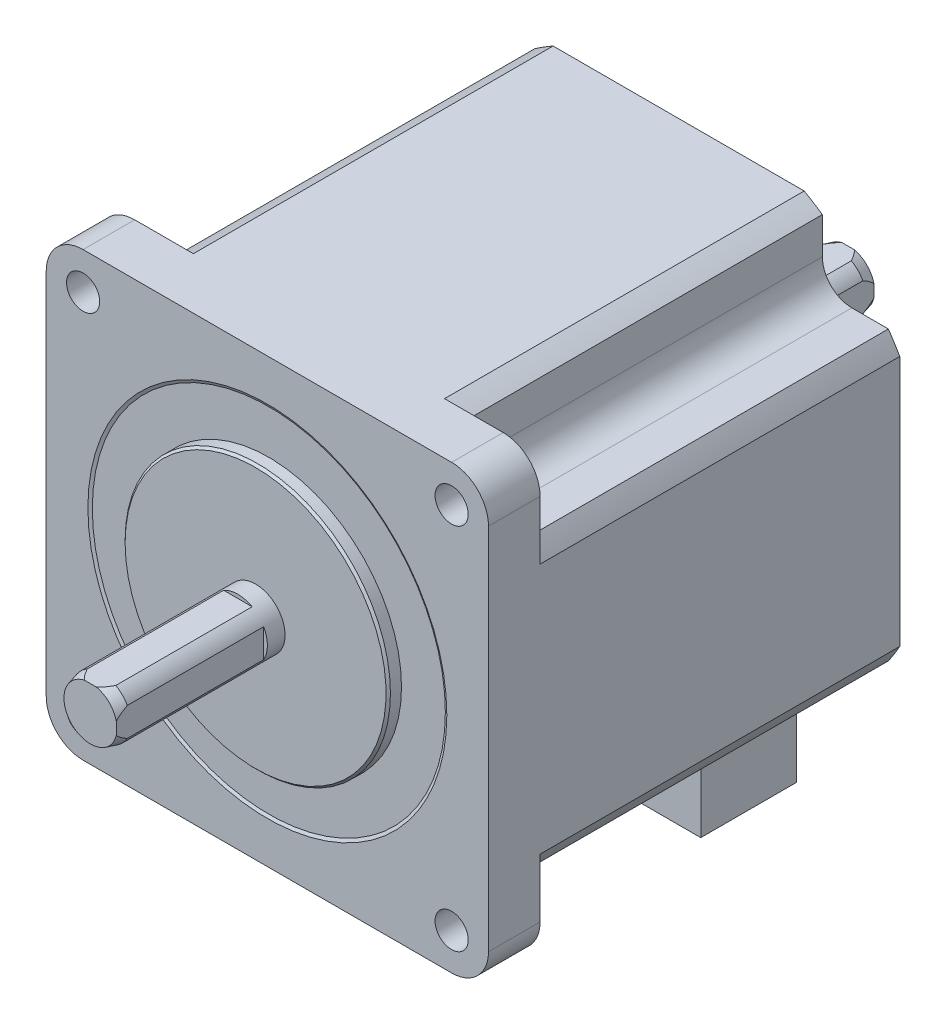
ISO-10303-21;
HEADER;
FILE_DESCRIPTION(('STEP AP214'),'2;1');
FILE_NAME('part.step','',(''),(''),'','','');
FILE_SCHEMA(('AUTOMOTIVE_DESIGN { 1 0 10303 214 1 1 1 1 }'));
ENDSEC;
DATA;
#1=APPLICATION_CONTEXT('core data for automotive mechanical design processes');
#2=APPLICATION_PROTOCOL_DEFINITION('international standard','automotive_design',2000,#1);
#3=PRODUCT_CONTEXT('',#1,'mechanical');
#4=PRODUCT('Part','Part','',(#3));
#5=PRODUCT_RELATED_PRODUCT_CATEGORY('part','',(#4));
#6=PRODUCT_DEFINITION_FORMATION('','',#4);
#7=PRODUCT_DEFINITION_CONTEXT('part definition',#1,'design');
#8=PRODUCT_DEFINITION('design','',#6,#7);
#9=PRODUCT_DEFINITION_SHAPE('','',#8);
#10=(LENGTH_UNIT() NAMED_UNIT(*) SI_UNIT(.MILLI.,.METRE.));
#11=(NAMED_UNIT(*) PLANE_ANGLE_UNIT() SI_UNIT($,.RADIAN.));
#12=(NAMED_UNIT(*) SI_UNIT($,.STERADIAN.) SOLID_ANGLE_UNIT());
#13=UNCERTAINTY_MEASURE_WITH_UNIT(LENGTH_MEASURE(1.E-05),#10,'distance_accuracy_value','');
#14=(GEOMETRIC_REPRESENTATION_CONTEXT(3) GLOBAL_UNCERTAINTY_ASSIGNED_CONTEXT((#13)) GLOBAL_UNIT_ASSIGNED_CONTEXT((#10,
#11,#12)) REPRESENTATION_CONTEXT('',''));
#15=CARTESIAN_POINT('',(0.,0.,0.));
#16=DIRECTION('',(0.,0.,1.));
#17=DIRECTION('',(1.,0.,0.));
#18=AXIS2_PLACEMENT_3D('',#15,#16,#17);
#19=CARTESIAN_POINT('',(0.,0.,-57.4));
#20=DIRECTION('',(0.,0.,-1.));
#21=DIRECTION('',(-1.,0.,0.));
#22=AXIS2_PLACEMENT_3D('',#19,#20,#21);
#23=PLANE('',#22);
#24=DIRECTION('',(0.,1.,0.));
#25=VECTOR('',#24,1.);
#26=CARTESIAN_POINT('',(-30.,0.,-57.4));
#27=LINE('',#26,#25);
#28=CARTESIAN_POINT('',(-30.,-17.0367250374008,-57.4));
#29=VERTEX_POINT('',#28);
#30=CARTESIAN_POINT('',(-30.,17.0367250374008,-57.4));
#31=VERTEX_POINT('',#30);
#32=EDGE_CURVE('E437',#29,#31,#27,.T.);
#33=ORIENTED_EDGE('',*,*,#32,.T.);
#34=CARTESIAN_POINT('',(0.,0.,-57.4));
#35=DIRECTION('',(0.,0.,-1.));
#36=DIRECTION('',(-1.,0.,0.));
#37=AXIS2_PLACEMENT_3D('',#34,#35,#36);
#38=CIRCLE('',#37,34.5);
#39=CARTESIAN_POINT('',(-28.4604989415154,19.5,-57.4));
#40=VERTEX_POINT('',#39);
#41=EDGE_CURVE('E440',#31,#40,#38,.T.);
#42=ORIENTED_EDGE('',*,*,#41,.T.);
#43=DIRECTION('',(-1.,0.,0.));
#44=VECTOR('',#43,1.);
#45=CARTESIAN_POINT('',(0.,19.5000000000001,-57.4));
#46=LINE('',#45,#44);
#47=CARTESIAN_POINT('',(-23.5,19.5,-57.4));
#48=VERTEX_POINT('',#47);
#49=EDGE_CURVE('E444',#48,#40,#46,.T.);
#50=ORIENTED_EDGE('',*,*,#49,.F.);
#51=CARTESIAN_POINT('',(-23.5,23.5,-57.4));
#52=DIRECTION('',(0.,0.,-1.));
#53=DIRECTION('',(-1.,0.,0.));
#54=AXIS2_PLACEMENT_3D('',#51,#52,#53);
#55=CIRCLE('',#54,4.);
#56=CARTESIAN_POINT('',(-19.5,23.5,-57.4));
#57=VERTEX_POINT('',#56);
#58=EDGE_CURVE('E568',#48,#57,#55,.F.);
#59=ORIENTED_EDGE('',*,*,#58,.T.);
#60=DIRECTION('',(0.,-1.,0.));
#61=VECTOR('',#60,1.);
#62=CARTESIAN_POINT('',(-19.5,0.,-57.4));
#63=LINE('',#62,#61);
#64=CARTESIAN_POINT('',(-19.5,28.4604989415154,-57.4));
#65=VERTEX_POINT('',#64);
#66=EDGE_CURVE('E448',#65,#57,#63,.T.);
#67=ORIENTED_EDGE('',*,*,#66,.F.);
#68=CARTESIAN_POINT('',(-17.0367250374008,30.,-57.4));
#69=VERTEX_POINT('',#68);
#70=EDGE_CURVE('E446',#65,#69,#38,.T.);
#71=ORIENTED_EDGE('',*,*,#70,.T.);
#72=DIRECTION('',(1.,0.,0.));
#73=VECTOR('',#72,1.);
#74=CARTESIAN_POINT('',(0.,30.,-57.4));
#75=LINE('',#74,#73);
#76=CARTESIAN_POINT('',(17.0367250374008,30.,-57.4));
#77=VERTEX_POINT('',#76);
#78=EDGE_CURVE('E451',#69,#77,#75,.T.);
#79=ORIENTED_EDGE('',*,*,#78,.T.);
#80=CARTESIAN_POINT('',(19.5,28.4604989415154,-57.4));
#81=VERTEX_POINT('',#80);
#82=EDGE_CURVE('E453',#77,#81,#38,.T.);
#83=ORIENTED_EDGE('',*,*,#82,.T.);
#84=DIRECTION('',(0.,-1.,0.));
#85=VECTOR('',#84,1.);
#86=CARTESIAN_POINT('',(19.5,0.,-57.4));
#87=LINE('',#86,#85);
#88=CARTESIAN_POINT('',(19.5,23.5,-57.4));
#89=VERTEX_POINT('',#88);
#90=EDGE_CURVE('E454',#81,#89,#87,.T.);
#91=ORIENTED_EDGE('',*,*,#90,.T.);
#92=CARTESIAN_POINT('',(23.5,23.5,-57.4));
#93=DIRECTION('',(0.,0.,-1.));
#94=DIRECTION('',(-1.,0.,0.));
#95=AXIS2_PLACEMENT_3D('',#92,#93,#94);
#96=CIRCLE('',#95,4.);
#97=CARTESIAN_POINT('',(23.5,19.5,-57.4));
#98=VERTEX_POINT('',#97);
#99=EDGE_CURVE('E570',#89,#98,#96,.F.);
#100=ORIENTED_EDGE('',*,*,#99,.T.);
#101=DIRECTION('',(-1.,0.,0.));
#102=VECTOR('',#101,1.);
#103=CARTESIAN_POINT('',(0.,19.5000000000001,-57.4));
#104=LINE('',#103,#102);
#105=CARTESIAN_POINT('',(28.4604989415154,19.5,-57.4));
#106=VERTEX_POINT('',#105);
#107=EDGE_CURVE('E457',#106,#98,#104,.T.);
#108=ORIENTED_EDGE('',*,*,#107,.F.);
#109=CARTESIAN_POINT('',(30.,17.0367250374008,-57.4));
#110=VERTEX_POINT('',#109);
#111=EDGE_CURVE('E460',#106,#110,#38,.T.);
#112=ORIENTED_EDGE('',*,*,#111,.T.);
#113=DIRECTION('',(0.,-1.,0.));
#114=VECTOR('',#113,1.);
#115=CARTESIAN_POINT('',(30.,0.,-57.4));
#116=LINE('',#115,#114);
#117=CARTESIAN_POINT('',(30.,-17.0367250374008,-57.4));
#118=VERTEX_POINT('',#117);
#119=EDGE_CURVE('E461',#110,#118,#116,.T.);
#120=ORIENTED_EDGE('',*,*,#119,.T.);
#121=CARTESIAN_POINT('',(28.4604989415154,-19.5,-57.4));
#122=VERTEX_POINT('',#121);
#123=EDGE_CURVE('E463',#118,#122,#38,.T.);
#124=ORIENTED_EDGE('',*,*,#123,.T.);
#125=DIRECTION('',(-1.,0.,0.));
#126=VECTOR('',#125,1.);
#127=CARTESIAN_POINT('',(0.,-19.4999999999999,-57.4));
#128=LINE('',#127,#126);
#129=CARTESIAN_POINT('',(23.5,-19.5,-57.4));
#130=VERTEX_POINT('',#129);
#131=EDGE_CURVE('E464',#122,#130,#128,.T.);
#132=ORIENTED_EDGE('',*,*,#131,.T.);
#133=CARTESIAN_POINT('',(23.5,-23.5,-57.4));
#134=DIRECTION('',(0.,0.,-1.));
#135=DIRECTION('',(-1.,0.,0.));
#136=AXIS2_PLACEMENT_3D('',#133,#134,#135);
#137=CIRCLE('',#136,4.);
#138=CARTESIAN_POINT('',(19.5,-23.5,-57.4));
#139=VERTEX_POINT('',#138);
#140=EDGE_CURVE('E564',#130,#139,#137,.F.);
#141=ORIENTED_EDGE('',*,*,#140,.T.);
#142=DIRECTION('',(0.,-1.,0.));
#143=VECTOR('',#142,1.);
#144=CARTESIAN_POINT('',(19.5,0.,-57.4));
#145=LINE('',#144,#143);
#146=CARTESIAN_POINT('',(19.5,-28.4604989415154,-57.4));
#147=VERTEX_POINT('',#146);
#148=EDGE_CURVE('E467',#139,#147,#145,.T.);
#149=ORIENTED_EDGE('',*,*,#148,.T.);
#150=CARTESIAN_POINT('',(17.0367250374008,-30.,-57.4));
#151=VERTEX_POINT('',#150);
#152=EDGE_CURVE('E469',#147,#151,#38,.T.);
#153=ORIENTED_EDGE('',*,*,#152,.T.);
#154=DIRECTION('',(-1.,0.,0.));
#155=VECTOR('',#154,1.);
#156=CARTESIAN_POINT('',(0.,-30.,-57.4));
#157=LINE('',#156,#155);
#158=CARTESIAN_POINT('',(16.,-30.,-57.4));
#159=VERTEX_POINT('',#158);
#160=EDGE_CURVE('E470',#151,#159,#157,.T.);
#161=ORIENTED_EDGE('',*,*,#160,.T.);
#162=DIRECTION('',(0.,1.,0.));
#163=VECTOR('',#162,1.);
#164=CARTESIAN_POINT('',(16.,-40.,-57.4));
#165=LINE('',#164,#163);
#166=CARTESIAN_POINT('',(16.,-40.,-57.4));
#167=VERTEX_POINT('',#166);
#168=EDGE_CURVE('E431',#167,#159,#165,.T.);
#169=ORIENTED_EDGE('',*,*,#168,.F.);
#170=DIRECTION('',(1.,0.,0.));
#171=VECTOR('',#170,1.);
#172=CARTESIAN_POINT('',(-16.,-40.,-57.4));
#173=LINE('',#172,#171);
#174=CARTESIAN_POINT('',(-16.,-40.,-57.4));
#175=VERTEX_POINT('',#174);
#176=EDGE_CURVE('E414',#175,#167,#173,.T.);
#177=ORIENTED_EDGE('',*,*,#176,.F.);
#178=DIRECTION('',(0.,1.,0.));
#179=VECTOR('',#178,1.);
#180=CARTESIAN_POINT('',(-16.,-40.,-57.4));
#181=LINE('',#180,#179);
#182=CARTESIAN_POINT('',(-16.,-30.,-57.4));
#183=VERTEX_POINT('',#182);
#184=EDGE_CURVE('E433',#175,#183,#181,.T.);
#185=ORIENTED_EDGE('',*,*,#184,.T.);
#186=CARTESIAN_POINT('',(-17.0367250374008,-30.,-57.4));
#187=VERTEX_POINT('',#186);
#188=EDGE_CURVE('E474',#183,#187,#157,.T.);
#189=ORIENTED_EDGE('',*,*,#188,.T.);
#190=CARTESIAN_POINT('',(-19.5,-28.4604989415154,-57.4));
#191=VERTEX_POINT('',#190);
#192=EDGE_CURVE('E473',#187,#191,#38,.T.);
#193=ORIENTED_EDGE('',*,*,#192,.T.);
#194=DIRECTION('',(0.,-1.,0.));
#195=VECTOR('',#194,1.);
#196=CARTESIAN_POINT('',(-19.5,0.,-57.4));
#197=LINE('',#196,#195);
#198=CARTESIAN_POINT('',(-19.5,-23.5,-57.4));
#199=VERTEX_POINT('',#198);
#200=EDGE_CURVE('E475',#199,#191,#197,.T.);
#201=ORIENTED_EDGE('',*,*,#200,.F.);
#202=CARTESIAN_POINT('',(-23.5,-23.5,-57.4));
#203=DIRECTION('',(0.,0.,-1.));
#204=DIRECTION('',(-1.,0.,0.));
#205=AXIS2_PLACEMENT_3D('',#202,#203,#204);
#206=CIRCLE('',#205,4.);
#207=CARTESIAN_POINT('',(-23.5,-19.5,-57.4));
#208=VERTEX_POINT('',#207);
#209=EDGE_CURVE('E566',#199,#208,#206,.F.);
#210=ORIENTED_EDGE('',*,*,#209,.T.);
#211=DIRECTION('',(-1.,0.,0.));
#212=VECTOR('',#211,1.);
#213=CARTESIAN_POINT('',(0.,-19.4999999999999,-57.4));
#214=LINE('',#213,#212);
#215=CARTESIAN_POINT('',(-28.4604989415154,-19.5,-57.4));
#216=VERTEX_POINT('',#215);
#217=EDGE_CURVE('E477',#208,#216,#214,.T.);
#218=ORIENTED_EDGE('',*,*,#217,.T.);
#219=EDGE_CURVE('E445',#216,#29,#38,.T.);
#220=ORIENTED_EDGE('',*,*,#219,.T.);
#221=EDGE_LOOP('',(#33,#42,#50,#59,#67,#71,#79,#83,#91,#100,#108,#112,#120,#124,#132,#141,#149,
#153,#161,#169,#177,#185,#189,#193,#201,#210,#218,#220));
#222=FACE_BOUND('',#221,.T.);
#223=CARTESIAN_POINT('',(0.,0.,-57.4));
#224=DIRECTION('',(0.,0.,-1.));
#225=DIRECTION('',(-1.,0.,0.));
#226=AXIS2_PLACEMENT_3D('',#223,#224,#225);
#227=CIRCLE('',#226,4.);
#228=CARTESIAN_POINT('',(-4.,0.,-57.4));
#229=VERTEX_POINT('',#228);
#230=EDGE_CURVE('E378',#229,#229,#227,.T.);
#231=ORIENTED_EDGE('',*,*,#230,.F.);
#232=EDGE_LOOP('',(#231));
#233=FACE_BOUND('',#232,.T.);
#234=ADVANCED_FACE('F39',(#222,#233),#23,.T.);
#235=CARTESIAN_POINT('',(0.,0.,22.4));
#236=DIRECTION('',(0.,0.,-1.));
#237=DIRECTION('',(-1.,0.,0.));
#238=AXIS2_PLACEMENT_3D('',#235,#236,#237);
#239=CONICAL_SURFACE('',#238,3.59807621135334,0.261799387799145);
#240=CARTESIAN_POINT('',(3.5,3.65885881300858,16.9316215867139));
#241=CARTESIAN_POINT('',(3.5,3.60239566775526,17.0838864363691));
#242=CARTESIAN_POINT('',(3.5,3.54539058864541,17.2359490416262));
#243=CARTESIAN_POINT('',(3.5,3.43012170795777,17.539604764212));
#244=CARTESIAN_POINT('',(3.5,3.37185784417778,17.6911978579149));
#245=CARTESIAN_POINT('',(3.5,3.19466893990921,18.1458077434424));
#246=CARTESIAN_POINT('',(3.5,3.07358949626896,18.4479953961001));
#247=CARTESIAN_POINT('',(3.5,2.88202757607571,18.9085831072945));
#248=CARTESIAN_POINT('',(3.5,2.81435636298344,19.0681529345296));
#249=CARTESIAN_POINT('',(3.5,2.67631316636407,19.3861181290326));
#250=CARTESIAN_POINT('',(3.5,2.60594127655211,19.5445135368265));
#251=CARTESIAN_POINT('',(3.5,2.46196785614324,19.8596093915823));
#252=CARTESIAN_POINT('',(3.5,2.38837023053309,20.0163116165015));
#253=CARTESIAN_POINT('',(3.5,2.23702965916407,20.3276939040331));
#254=CARTESIAN_POINT('',(3.5,2.15928717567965,20.4823741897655));
#255=CARTESIAN_POINT('',(3.5,1.9995675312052,20.786779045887));
#256=CARTESIAN_POINT('',(3.5,1.91766524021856,20.9365427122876));
#257=CARTESIAN_POINT('',(3.5,1.74677024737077,21.2323903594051));
#258=CARTESIAN_POINT('',(3.5,1.65776561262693,21.3784675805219));
#259=CARTESIAN_POINT('',(3.5,1.51770774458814,21.5916740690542));
#260=CARTESIAN_POINT('',(3.5,1.47033809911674,21.6612195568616));
#261=CARTESIAN_POINT('',(3.5,1.37275172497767,21.7982748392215));
#262=CARTESIAN_POINT('',(3.5,1.32253564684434,21.8657850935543));
#263=CARTESIAN_POINT('',(3.5,1.2187803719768,21.997919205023));
#264=CARTESIAN_POINT('',(3.5,1.16525083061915,22.0625505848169));
#265=CARTESIAN_POINT('',(3.5,1.05398107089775,22.1880495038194));
#266=CARTESIAN_POINT('',(3.5,0.996243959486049,22.2489197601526));
#267=CARTESIAN_POINT('',(3.5,0.879074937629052,22.3618808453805));
#268=CARTESIAN_POINT('',(3.5,0.819941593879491,22.4142773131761));
#269=CARTESIAN_POINT('',(3.5,0.696050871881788,22.5121419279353));
#270=CARTESIAN_POINT('',(3.5,0.631293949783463,22.5576106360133));
#271=CARTESIAN_POINT('',(3.5,0.507273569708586,22.6311614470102));
#272=CARTESIAN_POINT('',(3.5,0.449006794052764,22.6608914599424));
#273=CARTESIAN_POINT('',(3.5,0.328412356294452,22.7105403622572));
#274=CARTESIAN_POINT('',(3.5,0.266093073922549,22.7304788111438));
#275=CARTESIAN_POINT('',(3.5,0.149648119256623,22.7555691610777));
#276=CARTESIAN_POINT('',(3.5,0.0959490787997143,22.7626698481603));
#277=CARTESIAN_POINT('',(3.5,-0.01186972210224,22.7674965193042));
#278=CARTESIAN_POINT('',(3.5,-0.065989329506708,22.7652257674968));
#279=CARTESIAN_POINT('',(3.5,-0.172879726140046,22.7516191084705));
#280=CARTESIAN_POINT('',(3.5,-0.225653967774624,22.7403094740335));
#281=CARTESIAN_POINT('',(3.5,-0.328872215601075,22.7098978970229));
#282=CARTESIAN_POINT('',(3.5,-0.37931467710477,22.6907908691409));
#283=CARTESIAN_POINT('',(3.5,-0.508714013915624,22.6321380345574));
#284=CARTESIAN_POINT('',(3.5,-0.585263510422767,22.587337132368));
#285=CARTESIAN_POINT('',(3.5,-0.730938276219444,22.4869137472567));
#286=CARTESIAN_POINT('',(3.5,-0.800033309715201,22.4312495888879));
#287=CARTESIAN_POINT('',(3.5,-0.955746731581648,22.2916879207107));
#288=CARTESIAN_POINT('',(3.5,-1.03968917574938,22.2048513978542));
#289=CARTESIAN_POINT('',(3.5,-1.19908801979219,22.0236161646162));
#290=CARTESIAN_POINT('',(3.5,-1.27452504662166,21.9292009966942));
#291=CARTESIAN_POINT('',(3.5,-1.41979524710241,21.7344953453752));
#292=CARTESIAN_POINT('',(3.5,-1.48955344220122,21.6341495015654));
#293=CARTESIAN_POINT('',(3.5,-1.62395149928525,21.4302869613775));
#294=CARTESIAN_POINT('',(3.5,-1.68859694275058,21.3267738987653));
#295=CARTESIAN_POINT('',(3.5,-1.85613404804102,21.0470251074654));
#296=CARTESIAN_POINT('',(3.5,-1.95551266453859,20.8686941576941));
#297=CARTESIAN_POINT('',(3.5,-2.14665533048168,20.5079710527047));
#298=CARTESIAN_POINT('',(3.5,-2.23841606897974,20.3255771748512));
#299=CARTESIAN_POINT('',(3.5,-2.41645935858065,19.9576498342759));
#300=CARTESIAN_POINT('',(3.5,-2.50272932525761,19.7721103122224));
#301=CARTESIAN_POINT('',(3.5,-2.67090131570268,19.3990599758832));
#302=CARTESIAN_POINT('',(3.5,-2.7528030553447,19.2115490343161));
#303=CARTESIAN_POINT('',(3.5,-2.90658898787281,18.8504519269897));
#304=CARTESIAN_POINT('',(3.5,-2.97874468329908,18.6769809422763));
#305=CARTESIAN_POINT('',(3.5,-3.12065566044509,18.3290502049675));
#306=CARTESIAN_POINT('',(3.5,-3.19041080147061,18.1545903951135));
#307=CARTESIAN_POINT('',(3.5,-3.32757858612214,17.8057332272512));
#308=CARTESIAN_POINT('',(3.5,-3.39500096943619,17.6313396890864));
#309=CARTESIAN_POINT('',(3.5,-3.52813716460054,17.2819241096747));
#310=CARTESIAN_POINT('',(3.5,-3.59385117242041,17.1069021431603));
#311=CARTESIAN_POINT('',(3.5,-3.65885881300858,16.9316215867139));
#312=B_SPLINE_CURVE_WITH_KNOTS('',3,(#240,#241,#242,#243,#244,#245,#246,#247,#248,#249,#250,
#251,#252,#253,#254,#255,#256,#257,#258,#259,#260,#261,#262,#263,#264,#265,#266,#267,#268,#269,
#270,#271,#272,#273,#274,#275,#276,#277,#278,#279,#280,#281,#282,#283,#284,#285,#286,#287,#288,
#289,#290,#291,#292,#293,#294,#295,#296,#297,#298,#299,#300,#301,#302,#303,#304,#305,#306,#307,
#308,#309,#310,#311),.UNSPECIFIED.,.F.,.F.,(4,2,2,2,2,2,2,2,2,2,2,2,2,2,2,2,2,2,2,2,2,2,2,2,2,2,
2,2,2,2,2,2,2,2,2,4),(0.,0.487185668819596,0.974395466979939,1.95092394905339,2.47088362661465,
2.99082527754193,3.51015400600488,4.0294249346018,4.54139798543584,5.0542501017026,
5.30663191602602,5.55895628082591,5.81057715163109,6.0620140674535,6.29868754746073,
6.53534184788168,6.73093008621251,6.9261260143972,7.08786234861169,7.24954235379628,
7.4107541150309,7.5720711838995,7.83661046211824,8.10218530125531,8.46361083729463,
8.82584364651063,9.19226963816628,9.55828992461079,10.1704387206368,10.7828521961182,
11.3966221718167,12.0104320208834,12.574048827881,13.1376986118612,13.6986081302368,
14.2594530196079),.UNSPECIFIED.);
#313=CARTESIAN_POINT('',(3.5,1.93649167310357,20.9000000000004));
#314=VERTEX_POINT('',#313);
#315=CARTESIAN_POINT('',(3.5,0.834357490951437,22.4));
#316=VERTEX_POINT('',#315);
#317=EDGE_CURVE('E1505',#314,#316,#312,.T.);
#318=ORIENTED_EDGE('',*,*,#317,.F.);
#319=CARTESIAN_POINT('',(0.,0.,20.9));
#320=DIRECTION('',(0.,0.,1.));
#321=DIRECTION('',(1.,0.,0.));
#322=AXIS2_PLACEMENT_3D('',#319,#320,#321);
#323=CIRCLE('',#322,4.);
#324=CARTESIAN_POINT('',(1.93649167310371,3.5,20.9));
#325=VERTEX_POINT('',#324);
#326=EDGE_CURVE('E577',#325,#314,#323,.F.);
#327=ORIENTED_EDGE('',*,*,#326,.F.);
#328=CARTESIAN_POINT('',(-3.86930929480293,3.5,16.3564970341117));
#329=CARTESIAN_POINT('',(-3.81130684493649,3.5,16.5170199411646));
#330=CARTESIAN_POINT('',(-3.75279353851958,3.5,16.6773588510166));
#331=CARTESIAN_POINT('',(-3.6345807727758,3.5,16.9976052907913));
#332=CARTESIAN_POINT('',(-3.57488126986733,3.5,17.1575128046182));
#333=CARTESIAN_POINT('',(-3.39361030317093,3.5,17.6368798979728));
#334=CARTESIAN_POINT('',(-3.27001249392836,3.5,17.9555770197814));
#335=CARTESIAN_POINT('',(-3.0124423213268,3.5,18.5978750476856));
#336=CARTESIAN_POINT('',(-2.87828989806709,3.5,18.9214046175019));
#337=CARTESIAN_POINT('',(-2.66885480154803,3.5,19.4030223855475));
#338=CARTESIAN_POINT('',(-2.59769761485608,3.5,19.5629021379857));
#339=CARTESIAN_POINT('',(-2.45197127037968,3.5,19.8810939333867));
#340=CARTESIAN_POINT('',(-2.37740232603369,3.5,20.0394060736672));
#341=CARTESIAN_POINT('',(-2.2244181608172,3.5,20.3530265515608));
#342=CARTESIAN_POINT('',(-2.14602805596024,3.5,20.5083470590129));
#343=CARTESIAN_POINT('',(-1.98368792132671,3.5,20.816207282));
#344=CARTESIAN_POINT('',(-1.89973412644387,3.5,20.9687450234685));
#345=CARTESIAN_POINT('',(-1.72475802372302,3.5,21.2690282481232));
#346=CARTESIAN_POINT('',(-1.63376343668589,3.5,21.4167895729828));
#347=CARTESIAN_POINT('',(-1.48957033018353,3.5,21.6332031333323));
#348=CARTESIAN_POINT('',(-1.44025385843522,3.5,21.704429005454));
#349=CARTESIAN_POINT('',(-1.33846826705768,3.5,21.8445807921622));
#350=CARTESIAN_POINT('',(-1.28599919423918,3.5,21.913506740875));
#351=CARTESIAN_POINT('',(-1.15028154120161,3.5,22.0816859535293));
#352=CARTESIAN_POINT('',(-1.06463830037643,3.5,22.1790896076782));
#353=CARTESIAN_POINT('',(-0.927427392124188,3.5,22.3162128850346));
#354=CARTESIAN_POINT('',(-0.880306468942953,3.5,22.3603667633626));
#355=CARTESIAN_POINT('',(-0.782611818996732,3.5,22.4446415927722));
#356=CARTESIAN_POINT('',(-0.732041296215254,3.5,22.4847662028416));
#357=CARTESIAN_POINT('',(-0.626326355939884,3.5,22.5599557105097));
#358=CARTESIAN_POINT('',(-0.571136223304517,3.5,22.5949574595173));
#359=CARTESIAN_POINT('',(-0.456439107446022,3.5,22.6571140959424));
#360=CARTESIAN_POINT('',(-0.396936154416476,3.5,22.684276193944));
#361=CARTESIAN_POINT('',(-0.282931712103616,3.5,22.7248685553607));
#362=CARTESIAN_POINT('',(-0.228944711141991,3.5,22.7397133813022));
#363=CARTESIAN_POINT('',(-0.119250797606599,3.5,22.7600378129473));
#364=CARTESIAN_POINT('',(-0.0635463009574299,3.5,22.7655300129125));
#365=CARTESIAN_POINT('',(0.048071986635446,3.5,22.7664569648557));
#366=CARTESIAN_POINT('',(0.103985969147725,3.5,22.7618697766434));
#367=CARTESIAN_POINT('',(0.214216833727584,3.5,22.7432034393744));
#368=CARTESIAN_POINT('',(0.268531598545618,3.5,22.7291122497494));
#369=CARTESIAN_POINT('',(0.392914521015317,3.5,22.6866590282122));
#370=CARTESIAN_POINT('',(0.4618486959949,3.5,22.6550295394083));
#371=CARTESIAN_POINT('',(0.593979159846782,3.5,22.5815220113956));
#372=CARTESIAN_POINT('',(0.657160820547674,3.5,22.5396187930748));
#373=CARTESIAN_POINT('',(0.775505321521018,3.5,22.4508929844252));
#374=CARTESIAN_POINT('',(0.830900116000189,3.5,22.4043731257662));
#375=CARTESIAN_POINT('',(0.937609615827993,3.5,22.3068263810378));
#376=CARTESIAN_POINT('',(0.988920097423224,3.5,22.2557949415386));
#377=CARTESIAN_POINT('',(1.08824660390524,3.5,22.1503476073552));
#378=CARTESIAN_POINT('',(1.13625167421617,3.5,22.0959215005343));
#379=CARTESIAN_POINT('',(1.22933749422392,3.5,21.9846920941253));
#380=CARTESIAN_POINT('',(1.27441975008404,3.5,21.9278900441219));
#381=CARTESIAN_POINT('',(1.40470096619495,3.5,21.7565363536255));
#382=CARTESIAN_POINT('',(1.48644178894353,3.5,21.6393610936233));
#383=CARTESIAN_POINT('',(1.6431920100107,3.5,21.4005598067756));
#384=CARTESIAN_POINT('',(1.7181962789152,3.5,21.2789304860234));
#385=CARTESIAN_POINT('',(1.86323185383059,3.5,21.0323940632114));
#386=CARTESIAN_POINT('',(1.93325170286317,3.5,20.9074802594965));
#387=CARTESIAN_POINT('',(2.06928175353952,3.5,20.6554785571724));
#388=CARTESIAN_POINT('',(2.13529130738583,3.5,20.5283903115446));
#389=CARTESIAN_POINT('',(2.2644211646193,3.5,20.2719514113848));
#390=CARTESIAN_POINT('',(2.32752509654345,3.5,20.1425925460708));
#391=CARTESIAN_POINT('',(2.4510774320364,3.5,19.8826099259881));
#392=CARTESIAN_POINT('',(2.51152569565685,3.5,19.7519861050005));
#393=CARTESIAN_POINT('',(2.68941804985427,3.5,19.3589924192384));
#394=CARTESIAN_POINT('',(2.80358743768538,3.5,19.0951401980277));
#395=CARTESIAN_POINT('',(3.00048591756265,3.5,18.6248626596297));
#396=CARTESIAN_POINT('',(3.08448097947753,3.5,18.418960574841));
#397=CARTESIAN_POINT('',(3.24945704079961,3.5,18.0058641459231));
#398=CARTESIAN_POINT('',(3.33043691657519,3.5,17.798669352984));
#399=CARTESIAN_POINT('',(3.48887984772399,3.5,17.3860176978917));
#400=CARTESIAN_POINT('',(3.56637485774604,3.5,17.1805730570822));
#401=CARTESIAN_POINT('',(3.71929183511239,3.5,16.7690161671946));
#402=CARTESIAN_POINT('',(3.79471470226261,3.5,16.5629042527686));
#403=CARTESIAN_POINT('',(3.86930929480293,3.5,16.3564970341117));
#404=B_SPLINE_CURVE_WITH_KNOTS('',3,(#328,#329,#330,#331,#332,#333,#334,#335,#336,#337,#338,
#339,#340,#341,#342,#343,#344,#345,#346,#347,#348,#349,#350,#351,#352,#353,#354,#355,#356,#357,
#358,#359,#360,#361,#362,#363,#364,#365,#366,#367,#368,#369,#370,#371,#372,#373,#374,#375,#376,
#377,#378,#379,#380,#381,#382,#383,#384,#385,#386,#387,#388,#389,#390,#391,#392,#393,#394,#395,
#396,#397,#398,#399,#400,#401,#402,#403),.UNSPECIFIED.,.F.,.F.,(4,2,2,2,2,2,2,2,2,2,2,2,2,2,2,2,
2,2,2,2,2,2,2,2,2,2,2,2,2,2,2,2,2,2,2,2,2,4),(0.,0.512041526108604,1.02410189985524,
2.04951981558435,3.10007779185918,3.62504636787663,4.14998214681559,4.67184000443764,
5.19405469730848,5.71430882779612,5.9741287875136,6.2339448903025,6.62218502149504,
6.81575137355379,7.0091403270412,7.20474211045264,7.40016340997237,7.56743042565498,
7.73447202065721,7.90187758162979,8.06949562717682,8.29573563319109,8.52253575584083,
8.73922123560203,8.95612796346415,9.1737220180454,9.39120303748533,9.81942658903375,
10.247973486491,10.6774755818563,11.1070468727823,11.5387992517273,11.9705743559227,
12.8329204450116,13.500025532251,14.1673767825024,14.8260894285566,15.4845113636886),.UNSPECIFIED.);
#405=CARTESIAN_POINT('',(0.834357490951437,3.5,22.4));
#406=VERTEX_POINT('',#405);
#407=EDGE_CURVE('E580',#406,#325,#404,.T.);
#408=ORIENTED_EDGE('',*,*,#407,.F.);
#409=CARTESIAN_POINT('',(0.,0.,22.4));
#410=DIRECTION('',(0.,0.,1.));
#411=DIRECTION('',(1.,0.,0.));
#412=AXIS2_PLACEMENT_3D('',#409,#410,#411);
#413=CIRCLE('',#412,3.59807621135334);
#414=EDGE_CURVE('E572',#316,#406,#413,.T.);
#415=ORIENTED_EDGE('',*,*,#414,.F.);
#416=EDGE_LOOP('',(#318,#327,#408,#415));
#417=FACE_BOUND('',#416,.T.);
#418=ADVANCED_FACE('F625',(#417),#239,.T.);
#419=CARTESIAN_POINT('',(0.,0.,22.4));
#420=DIRECTION('',(0.,0.,-1.));
#421=DIRECTION('',(-1.,0.,0.));
#422=AXIS2_PLACEMENT_3D('',#419,#420,#421);
#423=CYLINDRICAL_SURFACE('',#422,4.);
#424=ORIENTED_EDGE('',*,*,#326,.T.);
#425=DIRECTION('',(0.,0.,-1.));
#426=VECTOR('',#425,1.);
#427=CARTESIAN_POINT('',(3.5,1.93649167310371,22.4));
#428=LINE('',#427,#426);
#429=CARTESIAN_POINT('',(3.5,1.93649167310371,2.4));
#430=VERTEX_POINT('',#429);
#431=EDGE_CURVE('E395',#314,#430,#428,.T.);
#432=ORIENTED_EDGE('',*,*,#431,.T.);
#433=CARTESIAN_POINT('',(0.,0.,2.4));
#434=DIRECTION('',(0.,0.,-1.));
#435=DIRECTION('',(-1.,0.,0.));
#436=AXIS2_PLACEMENT_3D('',#433,#434,#435);
#437=CIRCLE('',#436,4.);
#438=CARTESIAN_POINT('',(3.5,-1.93649167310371,2.4));
#439=VERTEX_POINT('',#438);
#440=EDGE_CURVE('E1506',#430,#439,#437,.T.);
#441=ORIENTED_EDGE('',*,*,#440,.T.);
#442=DIRECTION('',(0.,0.,-1.));
#443=VECTOR('',#442,1.);
#444=CARTESIAN_POINT('',(3.5,-1.93649167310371,22.4));
#445=LINE('',#444,#443);
#446=CARTESIAN_POINT('',(3.5,-1.93649167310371,20.9));
#447=VERTEX_POINT('',#446);
#448=EDGE_CURVE('E391',#439,#447,#445,.F.);
#449=ORIENTED_EDGE('',*,*,#448,.T.);
#450=CARTESIAN_POINT('',(-1.93649167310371,3.5,20.9));
#451=VERTEX_POINT('',#450);
#452=EDGE_CURVE('E576',#447,#451,#323,.F.);
#453=ORIENTED_EDGE('',*,*,#452,.T.);
#454=DIRECTION('',(0.,0.,-1.));
#455=VECTOR('',#454,1.);
#456=CARTESIAN_POINT('',(-1.93649167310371,3.5,22.4));
#457=LINE('',#456,#455);
#458=CARTESIAN_POINT('',(-1.93649167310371,3.5,2.4));
#459=VERTEX_POINT('',#458);
#460=EDGE_CURVE('E407',#451,#459,#457,.T.);
#461=ORIENTED_EDGE('',*,*,#460,.T.);
#462=CARTESIAN_POINT('',(0.,0.,2.4));
#463=DIRECTION('',(0.,0.,1.));
#464=DIRECTION('',(1.,0.,0.));
#465=AXIS2_PLACEMENT_3D('',#462,#463,#464);
#466=CIRCLE('',#465,4.);
#467=CARTESIAN_POINT('',(1.93649167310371,3.5,2.4));
#468=VERTEX_POINT('',#467);
#469=EDGE_CURVE('E588',#468,#459,#466,.T.);
#470=ORIENTED_EDGE('',*,*,#469,.F.);
#471=DIRECTION('',(0.,0.,-1.));
#472=VECTOR('',#471,1.);
#473=CARTESIAN_POINT('',(1.93649167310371,3.5,22.4));
#474=LINE('',#473,#472);
#475=EDGE_CURVE('E402',#468,#325,#474,.F.);
#476=ORIENTED_EDGE('',*,*,#475,.T.);
#477=EDGE_LOOP('',(#424,#432,#441,#449,#453,#461,#470,#476));
#478=FACE_BOUND('',#477,.T.);
#479=CARTESIAN_POINT('',(0.,0.,0.));
#480=DIRECTION('',(0.,0.,-1.));
#481=DIRECTION('',(-1.,0.,0.));
#482=AXIS2_PLACEMENT_3D('',#479,#480,#481);
#483=CIRCLE('',#482,4.);
#484=CARTESIAN_POINT('',(-4.,0.,0.));
#485=VERTEX_POINT('',#484);
#486=EDGE_CURVE('E878',#485,#485,#483,.T.);
#487=ORIENTED_EDGE('',*,*,#486,.F.);
#488=EDGE_LOOP('',(#487));
#489=FACE_BOUND('',#488,.T.);
#490=ADVANCED_FACE('F728',(#478,#489),#423,.T.);
#491=CARTESIAN_POINT('',(0.,0.,22.4));
#492=DIRECTION('',(0.,0.,1.));
#493=DIRECTION('',(1.,0.,0.));
#494=AXIS2_PLACEMENT_3D('',#491,#492,#493);
#495=PLANE('',#494);
#496=DIRECTION('',(0.,-1.,0.));
#497=VECTOR('',#496,1.);
#498=CARTESIAN_POINT('',(3.5,2.44128177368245,22.4));
#499=LINE('',#498,#497);
#500=CARTESIAN_POINT('',(3.5,-0.834357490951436,22.4));
#501=VERTEX_POINT('',#500);
#502=EDGE_CURVE('E387',#316,#501,#499,.T.);
#503=ORIENTED_EDGE('',*,*,#502,.F.);
#504=ORIENTED_EDGE('',*,*,#414,.T.);
#505=DIRECTION('',(1.,0.,0.));
#506=VECTOR('',#505,1.);
#507=CARTESIAN_POINT('',(-4.72781232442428,3.5,22.4));
#508=LINE('',#507,#506);
#509=CARTESIAN_POINT('',(-0.834357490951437,3.5,22.4));
#510=VERTEX_POINT('',#509);
#511=EDGE_CURVE('E398',#510,#406,#508,.T.);
#512=ORIENTED_EDGE('',*,*,#511,.F.);
#513=EDGE_CURVE('E573',#510,#501,#413,.T.);
#514=ORIENTED_EDGE('',*,*,#513,.T.);
#515=EDGE_LOOP('',(#503,#504,#512,#514));
#516=FACE_BOUND('',#515,.T.);
#517=ADVANCED_FACE('F721',(#516),#495,.T.);
#518=CARTESIAN_POINT('',(0.,0.,0.));
#519=DIRECTION('',(0.,0.,-1.));
#520=DIRECTION('',(-1.,0.,0.));
#521=AXIS2_PLACEMENT_3D('',#518,#519,#520);
#522=PLANE('',#521);
#523=CARTESIAN_POINT('',(0.,0.,0.));
#524=DIRECTION('',(0.,0.,-1.));
#525=DIRECTION('',(-1.,0.,0.));
#526=AXIS2_PLACEMENT_3D('',#523,#524,#525);
#527=CIRCLE('',#526,17.7);
#528=CARTESIAN_POINT('',(-17.7,0.,0.));
#529=VERTEX_POINT('',#528);
#530=EDGE_CURVE('E1512',#529,#529,#527,.F.);
#531=ORIENTED_EDGE('',*,*,#530,.T.);
#532=EDGE_LOOP('',(#531));
#533=FACE_BOUND('',#532,.T.);
#534=ORIENTED_EDGE('',*,*,#486,.T.);
#535=EDGE_LOOP('',(#534));
#536=FACE_BOUND('',#535,.T.);
#537=ADVANCED_FACE('F717',(#533,#536),#522,.F.);
#538=CARTESIAN_POINT('',(0.,0.,-1.6));
#539=DIRECTION('',(0.,0.,1.));
#540=DIRECTION('',(1.,0.,0.));
#541=AXIS2_PLACEMENT_3D('',#538,#539,#540);
#542=CYLINDRICAL_SURFACE('',#541,18.);
#543=CARTESIAN_POINT('',(0.,0.,-0.300000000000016));
#544=DIRECTION('',(0.,0.,-1.));
#545=DIRECTION('',(-1.,0.,0.));
#546=AXIS2_PLACEMENT_3D('',#543,#544,#545);
#547=CIRCLE('',#546,18.);
#548=CARTESIAN_POINT('',(-18.,0.,-0.300000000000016));
#549=VERTEX_POINT('',#548);
#550=EDGE_CURVE('E1509',#549,#549,#547,.T.);
#551=ORIENTED_EDGE('',*,*,#550,.T.);
#552=EDGE_LOOP('',(#551));
#553=FACE_BOUND('',#552,.T.);
#554=CARTESIAN_POINT('',(0.,0.,-1.8));
#555=DIRECTION('',(0.,0.,1.));
#556=DIRECTION('',(1.,0.,0.));
#557=AXIS2_PLACEMENT_3D('',#554,#555,#556);
#558=CIRCLE('',#557,18.);
#559=CARTESIAN_POINT('',(18.,0.,-1.8));
#560=VERTEX_POINT('',#559);
#561=EDGE_CURVE('E381',#560,#560,#558,.T.);
#562=ORIENTED_EDGE('',*,*,#561,.T.);
#563=EDGE_LOOP('',(#562));
#564=FACE_BOUND('',#563,.T.);
#565=ADVANCED_FACE('F720',(#553,#564),#542,.T.);
#566=EDGE_CURVE('E1500',#501,#447,#312,.T.);
#567=ORIENTED_EDGE('',*,*,#566,.F.);
#568=ORIENTED_EDGE('',*,*,#513,.F.);
#569=EDGE_CURVE('E587',#451,#510,#404,.T.);
#570=ORIENTED_EDGE('',*,*,#569,.F.);
#571=ORIENTED_EDGE('',*,*,#452,.F.);
#572=EDGE_LOOP('',(#567,#568,#570,#571));
#573=FACE_BOUND('',#572,.T.);
#574=ADVANCED_FACE('F590',(#573),#239,.T.);
#575=CARTESIAN_POINT('',(0.,0.,2.4));
#576=DIRECTION('',(0.,0.,1.));
#577=DIRECTION('',(1.,0.,0.));
#578=AXIS2_PLACEMENT_3D('',#575,#576,#577);
#579=PLANE('',#578);
#580=ORIENTED_EDGE('',*,*,#469,.T.);
#581=DIRECTION('',(1.,0.,0.));
#582=VECTOR('',#581,1.);
#583=CARTESIAN_POINT('',(-4.72781232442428,3.5,2.4));
#584=LINE('',#583,#582);
#585=EDGE_CURVE('E399',#459,#468,#584,.T.);
#586=ORIENTED_EDGE('',*,*,#585,.T.);
#587=EDGE_LOOP('',(#580,#586));
#588=FACE_BOUND('',#587,.T.);
#589=ADVANCED_FACE('F600',(#588),#579,.T.);
#590=CARTESIAN_POINT('',(-4.72781232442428,3.5,2.4));
#591=DIRECTION('',(0.,-1.,0.));
#592=DIRECTION('',(0.,0.,-1.));
#593=AXIS2_PLACEMENT_3D('',#590,#591,#592);
#594=PLANE('',#593);
#595=ORIENTED_EDGE('',*,*,#569,.T.);
#596=ORIENTED_EDGE('',*,*,#511,.T.);
#597=ORIENTED_EDGE('',*,*,#407,.T.);
#598=ORIENTED_EDGE('',*,*,#475,.F.);
#599=ORIENTED_EDGE('',*,*,#585,.F.);
#600=ORIENTED_EDGE('',*,*,#460,.F.);
#601=EDGE_LOOP('',(#595,#596,#597,#598,#599,#600));
#602=FACE_BOUND('',#601,.T.);
#603=ADVANCED_FACE('F594',(#602),#594,.F.);
#604=CARTESIAN_POINT('',(0.,0.,2.4));
#605=DIRECTION('',(0.,0.,-1.));
#606=DIRECTION('',(-1.,0.,0.));
#607=AXIS2_PLACEMENT_3D('',#604,#605,#606);
#608=PLANE('',#607);
#609=DIRECTION('',(0.,-1.,0.));
#610=VECTOR('',#609,1.);
#611=CARTESIAN_POINT('',(3.5,2.44128177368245,2.4));
#612=LINE('',#611,#610);
#613=EDGE_CURVE('E388',#430,#439,#612,.T.);
#614=ORIENTED_EDGE('',*,*,#613,.T.);
#615=ORIENTED_EDGE('',*,*,#440,.F.);
#616=EDGE_LOOP('',(#614,#615));
#617=FACE_BOUND('',#616,.T.);
#618=ADVANCED_FACE('F599',(#617),#608,.F.);
#619=CARTESIAN_POINT('',(3.5,2.44128177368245,2.4));
#620=DIRECTION('',(-1.,0.,0.));
#621=DIRECTION('',(0.,-1.,0.));
#622=AXIS2_PLACEMENT_3D('',#619,#620,#621);
#623=PLANE('',#622);
#624=ORIENTED_EDGE('',*,*,#317,.T.);
#625=ORIENTED_EDGE('',*,*,#502,.T.);
#626=ORIENTED_EDGE('',*,*,#566,.T.);
#627=ORIENTED_EDGE('',*,*,#448,.F.);
#628=ORIENTED_EDGE('',*,*,#613,.F.);
#629=ORIENTED_EDGE('',*,*,#431,.F.);
#630=EDGE_LOOP('',(#624,#625,#626,#627,#628,#629));
#631=FACE_BOUND('',#630,.T.);
#632=ADVANCED_FACE('F1081',(#631),#623,.F.);
#633=CARTESIAN_POINT('',(0.,0.,-0.300000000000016));
#634=DIRECTION('',(0.,0.,-1.));
#635=DIRECTION('',(-1.,0.,0.));
#636=AXIS2_PLACEMENT_3D('',#633,#634,#635);
#637=CONICAL_SURFACE('',#636,18.,0.785398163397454);
#638=ORIENTED_EDGE('',*,*,#530,.F.);
#639=EDGE_LOOP('',(#638));
#640=FACE_BOUND('',#639,.T.);
#641=ORIENTED_EDGE('',*,*,#550,.F.);
#642=EDGE_LOOP('',(#641));
#643=FACE_BOUND('',#642,.T.);
#644=ADVANCED_FACE('F1090',(#640,#643),#637,.T.);
#645=CARTESIAN_POINT('',(0.,0.,-1.8));
#646=DIRECTION('',(0.,0.,1.));
#647=DIRECTION('',(1.,0.,0.));
#648=AXIS2_PLACEMENT_3D('',#645,#646,#647);
#649=PLANE('',#648);
#650=CARTESIAN_POINT('',(0.,0.,-1.8));
#651=DIRECTION('',(0.,0.,1.));
#652=DIRECTION('',(1.,0.,0.));
#653=AXIS2_PLACEMENT_3D('',#650,#651,#652);
#654=CIRCLE('',#653,23.95);
#655=CARTESIAN_POINT('',(23.95,0.,-1.8));
#656=VERTEX_POINT('',#655);
#657=EDGE_CURVE('E1515',#656,#656,#654,.T.);
#658=ORIENTED_EDGE('',*,*,#657,.T.);
#659=EDGE_LOOP('',(#658));
#660=FACE_BOUND('',#659,.T.);
#661=ORIENTED_EDGE('',*,*,#561,.F.);
#662=EDGE_LOOP('',(#661));
#663=FACE_BOUND('',#662,.T.);
#664=ADVANCED_FACE('F638',(#660,#663),#649,.T.);
#665=CARTESIAN_POINT('',(0.,-19.4999999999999,-57.4));
#666=DIRECTION('',(0.,1.,0.));
#667=DIRECTION('',(-1.,0.,0.));
#668=AXIS2_PLACEMENT_3D('',#665,#666,#667);
#669=PLANE('',#668);
#670=ORIENTED_EDGE('',*,*,#217,.F.);
#671=DIRECTION('',(0.,0.,1.));
#672=VECTOR('',#671,1.);
#673=CARTESIAN_POINT('',(-23.5,-19.5,-57.4));
#674=LINE('',#673,#672);
#675=CARTESIAN_POINT('',(-23.5,-19.5,-8.6));
#676=VERTEX_POINT('',#675);
#677=EDGE_CURVE('E543',#208,#676,#674,.T.);
#678=ORIENTED_EDGE('',*,*,#677,.T.);
#679=DIRECTION('',(-1.,0.,0.));
#680=VECTOR('',#679,1.);
#681=CARTESIAN_POINT('',(0.,-19.4999999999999,-8.6));
#682=LINE('',#681,#680);
#683=CARTESIAN_POINT('',(-28.4604989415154,-19.5,-8.6));
#684=VERTEX_POINT('',#683);
#685=EDGE_CURVE('E801',#676,#684,#682,.T.);
#686=ORIENTED_EDGE('',*,*,#685,.T.);
#687=DIRECTION('',(0.,0.,1.));
#688=VECTOR('',#687,1.);
#689=CARTESIAN_POINT('',(-28.4604989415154,-19.5,-57.4));
#690=LINE('',#689,#688);
#691=EDGE_CURVE('E788',#216,#684,#690,.T.);
#692=ORIENTED_EDGE('',*,*,#691,.F.);
#693=EDGE_LOOP('',(#670,#678,#686,#692));
#694=FACE_BOUND('',#693,.T.);
#695=ADVANCED_FACE('F634',(#694),#669,.F.);
#696=CARTESIAN_POINT('',(-23.5,-23.5,-57.4));
#697=DIRECTION('',(0.,0.,1.));
#698=DIRECTION('',(1.,0.,0.));
#699=AXIS2_PLACEMENT_3D('',#696,#697,#698);
#700=CYLINDRICAL_SURFACE('',#699,4.);
#701=ORIENTED_EDGE('',*,*,#209,.F.);
#702=DIRECTION('',(0.,0.,1.));
#703=VECTOR('',#702,1.);
#704=CARTESIAN_POINT('',(-19.5,-23.5,-57.4));
#705=LINE('',#704,#703);
#706=CARTESIAN_POINT('',(-19.5,-23.5,-8.6));
#707=VERTEX_POINT('',#706);
#708=EDGE_CURVE('E548',#707,#199,#705,.F.);
#709=ORIENTED_EDGE('',*,*,#708,.F.);
#710=CARTESIAN_POINT('',(-23.5,-23.5,-8.6));
#711=DIRECTION('',(0.,0.,-1.));
#712=DIRECTION('',(-1.,0.,0.));
#713=AXIS2_PLACEMENT_3D('',#710,#711,#712);
#714=CIRCLE('',#713,4.);
#715=EDGE_CURVE('E546',#676,#707,#714,.T.);
#716=ORIENTED_EDGE('',*,*,#715,.F.);
#717=ORIENTED_EDGE('',*,*,#677,.F.);
#718=EDGE_LOOP('',(#701,#709,#716,#717));
#719=FACE_BOUND('',#718,.T.);
#720=ADVANCED_FACE('F637',(#719),#700,.F.);
#721=CARTESIAN_POINT('',(-19.5,0.,-57.4));
#722=DIRECTION('',(-1.,0.,0.));
#723=DIRECTION('',(0.,-1.,0.));
#724=AXIS2_PLACEMENT_3D('',#721,#722,#723);
#725=PLANE('',#724);
#726=DIRECTION('',(0.,-1.,0.));
#727=VECTOR('',#726,1.);
#728=CARTESIAN_POINT('',(-19.5,0.,-8.6));
#729=LINE('',#728,#727);
#730=CARTESIAN_POINT('',(-19.5,-28.4604989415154,-8.6));
#731=VERTEX_POINT('',#730);
#732=EDGE_CURVE('E954',#707,#731,#729,.T.);
#733=ORIENTED_EDGE('',*,*,#732,.F.);
#734=ORIENTED_EDGE('',*,*,#708,.T.);
#735=ORIENTED_EDGE('',*,*,#200,.T.);
#736=DIRECTION('',(0.,0.,1.));
#737=VECTOR('',#736,1.);
#738=CARTESIAN_POINT('',(-19.5,-28.4604989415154,-57.4));
#739=LINE('',#738,#737);
#740=EDGE_CURVE('E792',#191,#731,#739,.T.);
#741=ORIENTED_EDGE('',*,*,#740,.T.);
#742=EDGE_LOOP('',(#733,#734,#735,#741));
#743=FACE_BOUND('',#742,.T.);
#744=ADVANCED_FACE('F640',(#743),#725,.T.);
#745=CARTESIAN_POINT('',(-19.5,0.,-57.4));
#746=DIRECTION('',(-1.,0.,0.));
#747=DIRECTION('',(0.,-1.,0.));
#748=AXIS2_PLACEMENT_3D('',#745,#746,#747);
#749=PLANE('',#748);
#750=ORIENTED_EDGE('',*,*,#66,.T.);
#751=DIRECTION('',(0.,0.,1.));
#752=VECTOR('',#751,1.);
#753=CARTESIAN_POINT('',(-19.5,23.5,-8.6));
#754=LINE('',#753,#752);
#755=CARTESIAN_POINT('',(-19.5,23.5,-8.6));
#756=VERTEX_POINT('',#755);
#757=EDGE_CURVE('E550',#57,#756,#754,.T.);
#758=ORIENTED_EDGE('',*,*,#757,.T.);
#759=DIRECTION('',(0.,-1.,0.));
#760=VECTOR('',#759,1.);
#761=CARTESIAN_POINT('',(-19.5,0.,-8.6));
#762=LINE('',#761,#760);
#763=CARTESIAN_POINT('',(-19.5,28.4604989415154,-8.6));
#764=VERTEX_POINT('',#763);
#765=EDGE_CURVE('E529',#764,#756,#762,.T.);
#766=ORIENTED_EDGE('',*,*,#765,.F.);
#767=DIRECTION('',(0.,0.,1.));
#768=VECTOR('',#767,1.);
#769=CARTESIAN_POINT('',(-19.5,28.4604989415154,-57.4));
#770=LINE('',#769,#768);
#771=EDGE_CURVE('E532',#65,#764,#770,.T.);
#772=ORIENTED_EDGE('',*,*,#771,.F.);
#773=EDGE_LOOP('',(#750,#758,#766,#772));
#774=FACE_BOUND('',#773,.T.);
#775=ADVANCED_FACE('F643',(#774),#749,.T.);
#776=CARTESIAN_POINT('',(-23.5,23.5,-57.4));
#777=DIRECTION('',(0.,0.,-1.));
#778=DIRECTION('',(-1.,0.,0.));
#779=AXIS2_PLACEMENT_3D('',#776,#777,#778);
#780=CYLINDRICAL_SURFACE('',#779,4.);
#781=ORIENTED_EDGE('',*,*,#58,.F.);
#782=DIRECTION('',(0.,0.,1.));
#783=VECTOR('',#782,1.);
#784=CARTESIAN_POINT('',(-23.5,19.5,-57.4));
#785=LINE('',#784,#783);
#786=CARTESIAN_POINT('',(-23.5,19.5,-8.6));
#787=VERTEX_POINT('',#786);
#788=EDGE_CURVE('E555',#787,#48,#785,.F.);
#789=ORIENTED_EDGE('',*,*,#788,.F.);
#790=CARTESIAN_POINT('',(-23.5,23.5,-8.6));
#791=DIRECTION('',(0.,0.,-1.));
#792=DIRECTION('',(-1.,0.,0.));
#793=AXIS2_PLACEMENT_3D('',#790,#791,#792);
#794=CIRCLE('',#793,4.);
#795=EDGE_CURVE('E553',#756,#787,#794,.T.);
#796=ORIENTED_EDGE('',*,*,#795,.F.);
#797=ORIENTED_EDGE('',*,*,#757,.F.);
#798=EDGE_LOOP('',(#781,#789,#796,#797));
#799=FACE_BOUND('',#798,.T.);
#800=ADVANCED_FACE('F663',(#799),#780,.F.);
#801=CARTESIAN_POINT('',(0.,19.5000000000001,-57.4));
#802=DIRECTION('',(0.,1.,0.));
#803=DIRECTION('',(-1.,0.,0.));
#804=AXIS2_PLACEMENT_3D('',#801,#802,#803);
#805=PLANE('',#804);
#806=DIRECTION('',(-1.,0.,0.));
#807=VECTOR('',#806,1.);
#808=CARTESIAN_POINT('',(0.,19.5000000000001,-8.6));
#809=LINE('',#808,#807);
#810=CARTESIAN_POINT('',(-28.4604989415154,19.5,-8.6));
#811=VERTEX_POINT('',#810);
#812=EDGE_CURVE('E481',#787,#811,#809,.T.);
#813=ORIENTED_EDGE('',*,*,#812,.F.);
#814=ORIENTED_EDGE('',*,*,#788,.T.);
#815=ORIENTED_EDGE('',*,*,#49,.T.);
#816=DIRECTION('',(0.,0.,1.));
#817=VECTOR('',#816,1.);
#818=CARTESIAN_POINT('',(-28.4604989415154,19.5,-57.4));
#819=LINE('',#818,#817);
#820=EDGE_CURVE('E816',#40,#811,#819,.T.);
#821=ORIENTED_EDGE('',*,*,#820,.T.);
#822=EDGE_LOOP('',(#813,#814,#815,#821));
#823=FACE_BOUND('',#822,.T.);
#824=ADVANCED_FACE('F607',(#823),#805,.T.);
#825=CARTESIAN_POINT('',(0.,-40.,0.));
#826=DIRECTION('',(0.,1.,0.));
#827=DIRECTION('',(0.,0.,1.));
#828=AXIS2_PLACEMENT_3D('',#825,#826,#827);
#829=PLANE('',#828);
#830=DIRECTION('',(0.,0.,-1.));
#831=VECTOR('',#830,1.);
#832=CARTESIAN_POINT('',(-16.,-40.,-57.4));
#833=LINE('',#832,#831);
#834=CARTESIAN_POINT('',(-16.,-40.,-44.4));
#835=VERTEX_POINT('',#834);
#836=EDGE_CURVE('E411',#835,#175,#833,.T.);
#837=ORIENTED_EDGE('',*,*,#836,.T.);
#838=ORIENTED_EDGE('',*,*,#176,.T.);
#839=DIRECTION('',(0.,0.,1.));
#840=VECTOR('',#839,1.);
#841=CARTESIAN_POINT('',(16.,-40.,-57.4));
#842=LINE('',#841,#840);
#843=CARTESIAN_POINT('',(16.,-40.,-44.4));
#844=VERTEX_POINT('',#843);
#845=EDGE_CURVE('E417',#167,#844,#842,.T.);
#846=ORIENTED_EDGE('',*,*,#845,.T.);
#847=DIRECTION('',(-1.,0.,0.));
#848=VECTOR('',#847,1.);
#849=CARTESIAN_POINT('',(-16.,-40.,-44.4));
#850=LINE('',#849,#848);
#851=EDGE_CURVE('E419',#844,#835,#850,.T.);
#852=ORIENTED_EDGE('',*,*,#851,.T.);
#853=EDGE_LOOP('',(#837,#838,#846,#852));
#854=FACE_BOUND('',#853,.T.);
#855=ADVANCED_FACE('F603',(#854),#829,.F.);
#856=CARTESIAN_POINT('',(19.5,0.,-57.4));
#857=DIRECTION('',(-1.,0.,0.));
#858=DIRECTION('',(0.,-1.,0.));
#859=AXIS2_PLACEMENT_3D('',#856,#857,#858);
#860=PLANE('',#859);
#861=DIRECTION('',(0.,-1.,0.));
#862=VECTOR('',#861,1.);
#863=CARTESIAN_POINT('',(19.5,0.,-8.6));
#864=LINE('',#863,#862);
#865=CARTESIAN_POINT('',(19.5,28.4604989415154,-8.6));
#866=VERTEX_POINT('',#865);
#867=CARTESIAN_POINT('',(19.5,23.5,-8.6));
#868=VERTEX_POINT('',#867);
#869=EDGE_CURVE('E518',#866,#868,#864,.T.);
#870=ORIENTED_EDGE('',*,*,#869,.T.);
#871=DIRECTION('',(0.,0.,1.));
#872=VECTOR('',#871,1.);
#873=CARTESIAN_POINT('',(19.5,23.5,-57.4));
#874=LINE('',#873,#872);
#875=EDGE_CURVE('E562',#868,#89,#874,.F.);
#876=ORIENTED_EDGE('',*,*,#875,.T.);
#877=ORIENTED_EDGE('',*,*,#90,.F.);
#878=DIRECTION('',(0.,0.,1.));
#879=VECTOR('',#878,1.);
#880=CARTESIAN_POINT('',(19.5,28.4604989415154,-57.4));
#881=LINE('',#880,#879);
#882=EDGE_CURVE('E525',#81,#866,#881,.T.);
#883=ORIENTED_EDGE('',*,*,#882,.T.);
#884=EDGE_LOOP('',(#870,#876,#877,#883));
#885=FACE_BOUND('',#884,.T.);
#886=ADVANCED_FACE('F606',(#885),#860,.F.);
#887=CARTESIAN_POINT('',(23.5,23.5,-57.4));
#888=DIRECTION('',(0.,0.,1.));
#889=DIRECTION('',(1.,0.,0.));
#890=AXIS2_PLACEMENT_3D('',#887,#888,#889);
#891=CYLINDRICAL_SURFACE('',#890,4.);
#892=ORIENTED_EDGE('',*,*,#99,.F.);
#893=ORIENTED_EDGE('',*,*,#875,.F.);
#894=CARTESIAN_POINT('',(23.5,23.5,-8.6));
#895=DIRECTION('',(0.,0.,-1.));
#896=DIRECTION('',(-1.,0.,0.));
#897=AXIS2_PLACEMENT_3D('',#894,#895,#896);
#898=CIRCLE('',#897,4.);
#899=CARTESIAN_POINT('',(23.5,19.5,-8.6));
#900=VERTEX_POINT('',#899);
#901=EDGE_CURVE('E560',#900,#868,#898,.T.);
#902=ORIENTED_EDGE('',*,*,#901,.F.);
#903=DIRECTION('',(0.,0.,1.));
#904=VECTOR('',#903,1.);
#905=CARTESIAN_POINT('',(23.5,19.5,-57.4));
#906=LINE('',#905,#904);
#907=EDGE_CURVE('E557',#98,#900,#906,.T.);
#908=ORIENTED_EDGE('',*,*,#907,.F.);
#909=EDGE_LOOP('',(#892,#893,#902,#908));
#910=FACE_BOUND('',#909,.T.);
#911=ADVANCED_FACE('F656',(#910),#891,.F.);
#912=CARTESIAN_POINT('',(0.,19.5000000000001,-57.4));
#913=DIRECTION('',(0.,1.,0.));
#914=DIRECTION('',(-1.,0.,0.));
#915=AXIS2_PLACEMENT_3D('',#912,#913,#914);
#916=PLANE('',#915);
#917=ORIENTED_EDGE('',*,*,#107,.T.);
#918=ORIENTED_EDGE('',*,*,#907,.T.);
#919=DIRECTION('',(-1.,0.,0.));
#920=VECTOR('',#919,1.);
#921=CARTESIAN_POINT('',(0.,19.5000000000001,-8.6));
#922=LINE('',#921,#920);
#923=CARTESIAN_POINT('',(28.4604989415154,19.5,-8.6));
#924=VERTEX_POINT('',#923);
#925=EDGE_CURVE('E768',#924,#900,#922,.T.);
#926=ORIENTED_EDGE('',*,*,#925,.F.);
#927=DIRECTION('',(0.,0.,1.));
#928=VECTOR('',#927,1.);
#929=CARTESIAN_POINT('',(28.4604989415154,19.5,-57.4));
#930=LINE('',#929,#928);
#931=EDGE_CURVE('E766',#106,#924,#930,.T.);
#932=ORIENTED_EDGE('',*,*,#931,.F.);
#933=EDGE_LOOP('',(#917,#918,#926,#932));
#934=FACE_BOUND('',#933,.T.);
#935=ADVANCED_FACE('F652',(#934),#916,.T.);
#936=CARTESIAN_POINT('',(0.,-19.4999999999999,-57.4));
#937=DIRECTION('',(0.,1.,0.));
#938=DIRECTION('',(-1.,0.,0.));
#939=AXIS2_PLACEMENT_3D('',#936,#937,#938);
#940=PLANE('',#939);
#941=DIRECTION('',(-1.,0.,0.));
#942=VECTOR('',#941,1.);
#943=CARTESIAN_POINT('',(0.,-19.4999999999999,-8.6));
#944=LINE('',#943,#942);
#945=CARTESIAN_POINT('',(28.4604989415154,-19.5,-8.6));
#946=VERTEX_POINT('',#945);
#947=CARTESIAN_POINT('',(23.5,-19.5,-8.6));
#948=VERTEX_POINT('',#947);
#949=EDGE_CURVE('E955',#946,#948,#944,.T.);
#950=ORIENTED_EDGE('',*,*,#949,.T.);
#951=DIRECTION('',(0.,0.,1.));
#952=VECTOR('',#951,1.);
#953=CARTESIAN_POINT('',(23.5,-19.5,-57.4));
#954=LINE('',#953,#952);
#955=EDGE_CURVE('E541',#948,#130,#954,.F.);
#956=ORIENTED_EDGE('',*,*,#955,.T.);
#957=ORIENTED_EDGE('',*,*,#131,.F.);
#958=DIRECTION('',(0.,0.,1.));
#959=VECTOR('',#958,1.);
#960=CARTESIAN_POINT('',(28.4604989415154,-19.5,-57.4));
#961=LINE('',#960,#959);
#962=EDGE_CURVE('E807',#122,#946,#961,.T.);
#963=ORIENTED_EDGE('',*,*,#962,.T.);
#964=EDGE_LOOP('',(#950,#956,#957,#963));
#965=FACE_BOUND('',#964,.T.);
#966=ADVANCED_FACE('F649',(#965),#940,.F.);
#967=CARTESIAN_POINT('',(23.5,-23.5,-57.4));
#968=DIRECTION('',(0.,0.,-1.));
#969=DIRECTION('',(-1.,0.,0.));
#970=AXIS2_PLACEMENT_3D('',#967,#968,#969);
#971=CYLINDRICAL_SURFACE('',#970,4.);
#972=ORIENTED_EDGE('',*,*,#140,.F.);
#973=ORIENTED_EDGE('',*,*,#955,.F.);
#974=CARTESIAN_POINT('',(23.5,-23.5,-8.6));
#975=DIRECTION('',(0.,0.,-1.));
#976=DIRECTION('',(-1.,0.,0.));
#977=AXIS2_PLACEMENT_3D('',#974,#975,#976);
#978=CIRCLE('',#977,4.);
#979=CARTESIAN_POINT('',(19.5,-23.5,-8.6));
#980=VERTEX_POINT('',#979);
#981=EDGE_CURVE('E538',#980,#948,#978,.T.);
#982=ORIENTED_EDGE('',*,*,#981,.F.);
#983=DIRECTION('',(0.,0.,1.));
#984=VECTOR('',#983,1.);
#985=CARTESIAN_POINT('',(19.5,-23.5,-8.6));
#986=LINE('',#985,#984);
#987=EDGE_CURVE('E535',#139,#980,#986,.T.);
#988=ORIENTED_EDGE('',*,*,#987,.F.);
#989=EDGE_LOOP('',(#972,#973,#982,#988));
#990=FACE_BOUND('',#989,.T.);
#991=ADVANCED_FACE('F647',(#990),#971,.F.);
#992=CARTESIAN_POINT('',(19.5,0.,-57.4));
#993=DIRECTION('',(-1.,0.,0.));
#994=DIRECTION('',(0.,-1.,0.));
#995=AXIS2_PLACEMENT_3D('',#992,#993,#994);
#996=PLANE('',#995);
#997=ORIENTED_EDGE('',*,*,#148,.F.);
#998=ORIENTED_EDGE('',*,*,#987,.T.);
#999=DIRECTION('',(0.,-1.,0.));
#1000=VECTOR('',#999,1.);
#1001=CARTESIAN_POINT('',(19.5,0.,-8.6));
#1002=LINE('',#1001,#1000);
#1003=CARTESIAN_POINT('',(19.5,-28.4604989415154,-8.6));
#1004=VERTEX_POINT('',#1003);
#1005=EDGE_CURVE('E952',#980,#1004,#1002,.T.);
#1006=ORIENTED_EDGE('',*,*,#1005,.T.);
#1007=DIRECTION('',(0.,0.,1.));
#1008=VECTOR('',#1007,1.);
#1009=CARTESIAN_POINT('',(19.5,-28.4604989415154,-57.4));
#1010=LINE('',#1009,#1008);
#1011=EDGE_CURVE('E804',#147,#1004,#1010,.T.);
#1012=ORIENTED_EDGE('',*,*,#1011,.F.);
#1013=EDGE_LOOP('',(#997,#998,#1006,#1012));
#1014=FACE_BOUND('',#1013,.T.);
#1015=ADVANCED_FACE('F631',(#1014),#996,.F.);
#1016=CARTESIAN_POINT('',(0.,0.,-57.4));
#1017=DIRECTION('',(0.,0.,1.));
#1018=DIRECTION('',(1.,0.,0.));
#1019=AXIS2_PLACEMENT_3D('',#1016,#1017,#1018);
#1020=CYLINDRICAL_SURFACE('',#1019,34.5);
#1021=CARTESIAN_POINT('',(0.,0.,-8.6));
#1022=DIRECTION('',(0.,0.,-1.));
#1023=DIRECTION('',(-1.,0.,0.));
#1024=AXIS2_PLACEMENT_3D('',#1021,#1022,#1023);
#1025=CIRCLE('',#1024,34.5);
#1026=CARTESIAN_POINT('',(-30.,-17.0367250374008,-8.6));
#1027=VERTEX_POINT('',#1026);
#1028=EDGE_CURVE('E441',#684,#1027,#1025,.T.);
#1029=ORIENTED_EDGE('',*,*,#1028,.T.);
#1030=DIRECTION('',(0.,0.,1.));
#1031=VECTOR('',#1030,1.);
#1032=CARTESIAN_POINT('',(-30.,-17.0367250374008,-57.4));
#1033=LINE('',#1032,#1031);
#1034=EDGE_CURVE('E784',#29,#1027,#1033,.T.);
#1035=ORIENTED_EDGE('',*,*,#1034,.F.);
#1036=ORIENTED_EDGE('',*,*,#219,.F.);
#1037=ORIENTED_EDGE('',*,*,#691,.T.);
#1038=EDGE_LOOP('',(#1029,#1035,#1036,#1037));
#1039=FACE_BOUND('',#1038,.T.);
#1040=ADVANCED_FACE('F627',(#1039),#1020,.T.);
#1041=CARTESIAN_POINT('',(-30.,17.0367250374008,-8.6));
#1042=VERTEX_POINT('',#1041);
#1043=EDGE_CURVE('E436',#1042,#811,#1025,.T.);
#1044=ORIENTED_EDGE('',*,*,#1043,.T.);
#1045=ORIENTED_EDGE('',*,*,#820,.F.);
#1046=ORIENTED_EDGE('',*,*,#41,.F.);
#1047=DIRECTION('',(0.,0.,1.));
#1048=VECTOR('',#1047,1.);
#1049=CARTESIAN_POINT('',(-30.,17.0367250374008,-57.4));
#1050=LINE('',#1049,#1048);
#1051=EDGE_CURVE('E819',#31,#1042,#1050,.T.);
#1052=ORIENTED_EDGE('',*,*,#1051,.T.);
#1053=EDGE_LOOP('',(#1044,#1045,#1046,#1052));
#1054=FACE_BOUND('',#1053,.T.);
#1055=ADVANCED_FACE('F630',(#1054),#1020,.T.);
#1056=CARTESIAN_POINT('',(-17.0367250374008,30.,-8.6));
#1057=VERTEX_POINT('',#1056);
#1058=EDGE_CURVE('E519',#764,#1057,#1025,.T.);
#1059=ORIENTED_EDGE('',*,*,#1058,.T.);
#1060=DIRECTION('',(0.,0.,1.));
#1061=VECTOR('',#1060,1.);
#1062=CARTESIAN_POINT('',(-17.0367250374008,30.,-57.4));
#1063=LINE('',#1062,#1061);
#1064=EDGE_CURVE('E524',#69,#1057,#1063,.T.);
#1065=ORIENTED_EDGE('',*,*,#1064,.F.);
#1066=ORIENTED_EDGE('',*,*,#70,.F.);
#1067=ORIENTED_EDGE('',*,*,#771,.T.);
#1068=EDGE_LOOP('',(#1059,#1065,#1066,#1067));
#1069=FACE_BOUND('',#1068,.T.);
#1070=ADVANCED_FACE('F978',(#1069),#1020,.T.);
#1071=CARTESIAN_POINT('',(17.0367250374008,30.,-8.6));
#1072=VERTEX_POINT('',#1071);
#1073=EDGE_CURVE('E514',#1072,#866,#1025,.T.);
#1074=ORIENTED_EDGE('',*,*,#1073,.T.);
#1075=ORIENTED_EDGE('',*,*,#882,.F.);
#1076=ORIENTED_EDGE('',*,*,#82,.F.);
#1077=DIRECTION('',(0.,0.,1.));
#1078=VECTOR('',#1077,1.);
#1079=CARTESIAN_POINT('',(17.0367250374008,30.,-57.4));
#1080=LINE('',#1079,#1078);
#1081=EDGE_CURVE('E521',#77,#1072,#1080,.T.);
#1082=ORIENTED_EDGE('',*,*,#1081,.T.);
#1083=EDGE_LOOP('',(#1074,#1075,#1076,#1082));
#1084=FACE_BOUND('',#1083,.T.);
#1085=ADVANCED_FACE('F692',(#1084),#1020,.T.);
#1086=CARTESIAN_POINT('',(-30.,-30.,-8.6));
#1087=DIRECTION('',(0.,0.,-1.));
#1088=DIRECTION('',(-1.,0.,0.));
#1089=AXIS2_PLACEMENT_3D('',#1086,#1087,#1088);
#1090=PLANE('',#1089);
#1091=ORIENTED_EDGE('',*,*,#765,.T.);
#1092=ORIENTED_EDGE('',*,*,#795,.T.);
#1093=ORIENTED_EDGE('',*,*,#812,.T.);
#1094=ORIENTED_EDGE('',*,*,#1043,.F.);
#1095=DIRECTION('',(0.,1.,0.));
#1096=VECTOR('',#1095,1.);
#1097=CARTESIAN_POINT('',(-30.,30.,-8.6));
#1098=LINE('',#1097,#1096);
#1099=CARTESIAN_POINT('',(-30.,25.,-8.6));
#1100=VERTEX_POINT('',#1099);
#1101=EDGE_CURVE('E851',#1042,#1100,#1098,.T.);
#1102=ORIENTED_EDGE('',*,*,#1101,.T.);
#1103=CARTESIAN_POINT('',(-25.,25.,-8.6));
#1104=DIRECTION('',(0.,0.,-1.));
#1105=DIRECTION('',(-1.,0.,0.));
#1106=AXIS2_PLACEMENT_3D('',#1103,#1104,#1105);
#1107=CIRCLE('',#1106,5.);
#1108=CARTESIAN_POINT('',(-25.,30.,-8.6));
#1109=VERTEX_POINT('',#1108);
#1110=EDGE_CURVE('E903',#1100,#1109,#1107,.T.);
#1111=ORIENTED_EDGE('',*,*,#1110,.T.);
#1112=DIRECTION('',(1.,0.,0.));
#1113=VECTOR('',#1112,1.);
#1114=CARTESIAN_POINT('',(30.,30.,-8.6));
#1115=LINE('',#1114,#1113);
#1116=EDGE_CURVE('E921',#1109,#1057,#1115,.T.);
#1117=ORIENTED_EDGE('',*,*,#1116,.T.);
#1118=ORIENTED_EDGE('',*,*,#1058,.F.);
#1119=EDGE_LOOP('',(#1091,#1092,#1093,#1094,#1102,#1111,#1117,#1118));
#1120=FACE_BOUND('',#1119,.T.);
#1121=CARTESIAN_POINT('',(-25.,25.,-8.6));
#1122=DIRECTION('',(0.,0.,-1.));
#1123=DIRECTION('',(-1.,0.,0.));
#1124=AXIS2_PLACEMENT_3D('',#1121,#1122,#1123);
#1125=CIRCLE('',#1124,2.25);
#1126=CARTESIAN_POINT('',(-27.25,25.,-8.6));
#1127=VERTEX_POINT('',#1126);
#1128=EDGE_CURVE('E839',#1127,#1127,#1125,.T.);
#1129=ORIENTED_EDGE('',*,*,#1128,.F.);
#1130=EDGE_LOOP('',(#1129));
#1131=FACE_BOUND('',#1130,.T.);
#1132=ADVANCED_FACE('F688',(#1120,#1131),#1090,.T.);
#1133=CARTESIAN_POINT('',(30.,17.0367250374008,-8.6));
#1134=VERTEX_POINT('',#1133);
#1135=EDGE_CURVE('E510',#924,#1134,#1025,.T.);
#1136=ORIENTED_EDGE('',*,*,#1135,.T.);
#1137=DIRECTION('',(0.,0.,1.));
#1138=VECTOR('',#1137,1.);
#1139=CARTESIAN_POINT('',(30.,17.0367250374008,-57.4));
#1140=LINE('',#1139,#1138);
#1141=EDGE_CURVE('E771',#110,#1134,#1140,.T.);
#1142=ORIENTED_EDGE('',*,*,#1141,.F.);
#1143=ORIENTED_EDGE('',*,*,#111,.F.);
#1144=ORIENTED_EDGE('',*,*,#931,.T.);
#1145=EDGE_LOOP('',(#1136,#1142,#1143,#1144));
#1146=FACE_BOUND('',#1145,.T.);
#1147=ADVANCED_FACE('F691',(#1146),#1020,.T.);
#1148=CARTESIAN_POINT('',(30.,-17.0367250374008,-8.6));
#1149=VERTEX_POINT('',#1148);
#1150=EDGE_CURVE('E506',#1149,#946,#1025,.T.);
#1151=ORIENTED_EDGE('',*,*,#1150,.T.);
#1152=ORIENTED_EDGE('',*,*,#962,.F.);
#1153=ORIENTED_EDGE('',*,*,#123,.F.);
#1154=DIRECTION('',(0.,0.,1.));
#1155=VECTOR('',#1154,1.);
#1156=CARTESIAN_POINT('',(30.,-17.0367250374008,-57.4));
#1157=LINE('',#1156,#1155);
#1158=EDGE_CURVE('E810',#118,#1149,#1157,.T.);
#1159=ORIENTED_EDGE('',*,*,#1158,.T.);
#1160=EDGE_LOOP('',(#1151,#1152,#1153,#1159));
#1161=FACE_BOUND('',#1160,.T.);
#1162=ADVANCED_FACE('F987',(#1161),#1020,.T.);
#1163=CARTESIAN_POINT('',(-17.0367250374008,-30.,-8.6));
#1164=VERTEX_POINT('',#1163);
#1165=EDGE_CURVE('E496',#1164,#731,#1025,.T.);
#1166=ORIENTED_EDGE('',*,*,#1165,.T.);
#1167=ORIENTED_EDGE('',*,*,#740,.F.);
#1168=ORIENTED_EDGE('',*,*,#192,.F.);
#1169=DIRECTION('',(0.,0.,1.));
#1170=VECTOR('',#1169,1.);
#1171=CARTESIAN_POINT('',(-17.0367250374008,-30.,-57.4));
#1172=LINE('',#1171,#1170);
#1173=EDGE_CURVE('E798',#187,#1164,#1172,.T.);
#1174=ORIENTED_EDGE('',*,*,#1173,.T.);
#1175=EDGE_LOOP('',(#1166,#1167,#1168,#1174));
#1176=FACE_BOUND('',#1175,.T.);
#1177=ADVANCED_FACE('F633',(#1176),#1020,.T.);
#1178=ORIENTED_EDGE('',*,*,#685,.F.);
#1179=ORIENTED_EDGE('',*,*,#715,.T.);
#1180=ORIENTED_EDGE('',*,*,#732,.T.);
#1181=ORIENTED_EDGE('',*,*,#1165,.F.);
#1182=DIRECTION('',(-1.,0.,0.));
#1183=VECTOR('',#1182,1.);
#1184=CARTESIAN_POINT('',(30.,-30.,-8.6));
#1185=LINE('',#1184,#1183);
#1186=CARTESIAN_POINT('',(-25.,-30.,-8.6));
#1187=VERTEX_POINT('',#1186);
#1188=EDGE_CURVE('E857',#1164,#1187,#1185,.T.);
#1189=ORIENTED_EDGE('',*,*,#1188,.T.);
#1190=CARTESIAN_POINT('',(-25.,-25.,-8.6));
#1191=DIRECTION('',(0.,0.,-1.));
#1192=DIRECTION('',(-1.,0.,0.));
#1193=AXIS2_PLACEMENT_3D('',#1190,#1191,#1192);
#1194=CIRCLE('',#1193,5.);
#1195=CARTESIAN_POINT('',(-30.,-25.,-8.6));
#1196=VERTEX_POINT('',#1195);
#1197=EDGE_CURVE('E905',#1187,#1196,#1194,.T.);
#1198=ORIENTED_EDGE('',*,*,#1197,.T.);
#1199=EDGE_CURVE('E854',#1196,#1027,#1098,.T.);
#1200=ORIENTED_EDGE('',*,*,#1199,.T.);
#1201=ORIENTED_EDGE('',*,*,#1028,.F.);
#1202=EDGE_LOOP('',(#1178,#1179,#1180,#1181,#1189,#1198,#1200,#1201));
#1203=FACE_BOUND('',#1202,.T.);
#1204=CARTESIAN_POINT('',(-25.,-25.,-8.6));
#1205=DIRECTION('',(0.,0.,-1.));
#1206=DIRECTION('',(-1.,0.,0.));
#1207=AXIS2_PLACEMENT_3D('',#1204,#1205,#1206);
#1208=CIRCLE('',#1207,2.25);
#1209=CARTESIAN_POINT('',(-27.25,-25.,-8.6));
#1210=VERTEX_POINT('',#1209);
#1211=EDGE_CURVE('E827',#1210,#1210,#1208,.T.);
#1212=ORIENTED_EDGE('',*,*,#1211,.F.);
#1213=EDGE_LOOP('',(#1212));
#1214=FACE_BOUND('',#1213,.T.);
#1215=ADVANCED_FACE('F694',(#1203,#1214),#1090,.T.);
#1216=CARTESIAN_POINT('',(17.0367250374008,-30.,-8.6));
#1217=VERTEX_POINT('',#1216);
#1218=EDGE_CURVE('E501',#1004,#1217,#1025,.T.);
#1219=ORIENTED_EDGE('',*,*,#1218,.T.);
#1220=DIRECTION('',(0.,0.,1.));
#1221=VECTOR('',#1220,1.);
#1222=CARTESIAN_POINT('',(17.0367250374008,-30.,-57.4));
#1223=LINE('',#1222,#1221);
#1224=EDGE_CURVE('E808',#151,#1217,#1223,.T.);
#1225=ORIENTED_EDGE('',*,*,#1224,.F.);
#1226=ORIENTED_EDGE('',*,*,#152,.F.);
#1227=ORIENTED_EDGE('',*,*,#1011,.T.);
#1228=EDGE_LOOP('',(#1219,#1225,#1226,#1227));
#1229=FACE_BOUND('',#1228,.T.);
#1230=ADVANCED_FACE('F617',(#1229),#1020,.T.);
#1231=CARTESIAN_POINT('',(16.,-40.,-57.4));
#1232=DIRECTION('',(-1.,0.,0.));
#1233=DIRECTION('',(0.,0.,1.));
#1234=AXIS2_PLACEMENT_3D('',#1231,#1232,#1233);
#1235=PLANE('',#1234);
#1236=DIRECTION('',(0.,0.,1.));
#1237=VECTOR('',#1236,1.);
#1238=CARTESIAN_POINT('',(16.,-30.,-57.4));
#1239=LINE('',#1238,#1237);
#1240=CARTESIAN_POINT('',(16.,-30.,-44.4));
#1241=VERTEX_POINT('',#1240);
#1242=EDGE_CURVE('E423',#159,#1241,#1239,.T.);
#1243=ORIENTED_EDGE('',*,*,#1242,.T.);
#1244=DIRECTION('',(0.,1.,0.));
#1245=VECTOR('',#1244,1.);
#1246=CARTESIAN_POINT('',(16.,-40.,-44.4));
#1247=LINE('',#1246,#1245);
#1248=EDGE_CURVE('E428',#844,#1241,#1247,.T.);
#1249=ORIENTED_EDGE('',*,*,#1248,.F.);
#1250=ORIENTED_EDGE('',*,*,#845,.F.);
#1251=ORIENTED_EDGE('',*,*,#168,.T.);
#1252=EDGE_LOOP('',(#1243,#1249,#1250,#1251));
#1253=FACE_BOUND('',#1252,.T.);
#1254=ADVANCED_FACE('F613',(#1253),#1235,.F.);
#1255=CARTESIAN_POINT('',(-16.,-40.,-44.4));
#1256=DIRECTION('',(0.,0.,-1.));
#1257=DIRECTION('',(-1.,0.,0.));
#1258=AXIS2_PLACEMENT_3D('',#1255,#1256,#1257);
#1259=PLANE('',#1258);
#1260=DIRECTION('',(-1.,0.,0.));
#1261=VECTOR('',#1260,1.);
#1262=CARTESIAN_POINT('',(-16.,-30.,-44.4));
#1263=LINE('',#1262,#1261);
#1264=CARTESIAN_POINT('',(-16.,-30.,-44.4));
#1265=VERTEX_POINT('',#1264);
#1266=EDGE_CURVE('E415',#1241,#1265,#1263,.T.);
#1267=ORIENTED_EDGE('',*,*,#1266,.T.);
#1268=DIRECTION('',(0.,1.,0.));
#1269=VECTOR('',#1268,1.);
#1270=CARTESIAN_POINT('',(-16.,-40.,-44.4));
#1271=LINE('',#1270,#1269);
#1272=EDGE_CURVE('E421',#835,#1265,#1271,.T.);
#1273=ORIENTED_EDGE('',*,*,#1272,.F.);
#1274=ORIENTED_EDGE('',*,*,#851,.F.);
#1275=ORIENTED_EDGE('',*,*,#1248,.T.);
#1276=EDGE_LOOP('',(#1267,#1273,#1274,#1275));
#1277=FACE_BOUND('',#1276,.T.);
#1278=ADVANCED_FACE('F609',(#1277),#1259,.F.);
#1279=CARTESIAN_POINT('',(-16.,-40.,-57.4));
#1280=DIRECTION('',(1.,0.,0.));
#1281=DIRECTION('',(0.,0.,-1.));
#1282=AXIS2_PLACEMENT_3D('',#1279,#1280,#1281);
#1283=PLANE('',#1282);
#1284=DIRECTION('',(0.,0.,-1.));
#1285=VECTOR('',#1284,1.);
#1286=CARTESIAN_POINT('',(-16.,-30.,-57.4));
#1287=LINE('',#1286,#1285);
#1288=EDGE_CURVE('E410',#1265,#183,#1287,.T.);
#1289=ORIENTED_EDGE('',*,*,#1288,.T.);
#1290=ORIENTED_EDGE('',*,*,#184,.F.);
#1291=ORIENTED_EDGE('',*,*,#836,.F.);
#1292=ORIENTED_EDGE('',*,*,#1272,.T.);
#1293=EDGE_LOOP('',(#1289,#1290,#1291,#1292));
#1294=FACE_BOUND('',#1293,.T.);
#1295=ADVANCED_FACE('F612',(#1294),#1283,.F.);
#1296=ORIENTED_EDGE('',*,*,#925,.T.);
#1297=ORIENTED_EDGE('',*,*,#901,.T.);
#1298=ORIENTED_EDGE('',*,*,#869,.F.);
#1299=ORIENTED_EDGE('',*,*,#1073,.F.);
#1300=CARTESIAN_POINT('',(25.,30.,-8.6));
#1301=VERTEX_POINT('',#1300);
#1302=EDGE_CURVE('E856',#1072,#1301,#1115,.T.);
#1303=ORIENTED_EDGE('',*,*,#1302,.T.);
#1304=CARTESIAN_POINT('',(25.,25.,-8.6));
#1305=DIRECTION('',(0.,0.,-1.));
#1306=DIRECTION('',(-1.,0.,0.));
#1307=AXIS2_PLACEMENT_3D('',#1304,#1305,#1306);
#1308=CIRCLE('',#1307,5.);
#1309=CARTESIAN_POINT('',(30.,25.,-8.6));
#1310=VERTEX_POINT('',#1309);
#1311=EDGE_CURVE('E901',#1301,#1310,#1308,.T.);
#1312=ORIENTED_EDGE('',*,*,#1311,.T.);
#1313=DIRECTION('',(0.,-1.,0.));
#1314=VECTOR('',#1313,1.);
#1315=CARTESIAN_POINT('',(30.,30.,-8.6));
#1316=LINE('',#1315,#1314);
#1317=EDGE_CURVE('E861',#1310,#1134,#1316,.T.);
#1318=ORIENTED_EDGE('',*,*,#1317,.T.);
#1319=ORIENTED_EDGE('',*,*,#1135,.F.);
#1320=EDGE_LOOP('',(#1296,#1297,#1298,#1299,#1303,#1312,#1318,#1319));
#1321=FACE_BOUND('',#1320,.T.);
#1322=CARTESIAN_POINT('',(25.,25.,-8.6));
#1323=DIRECTION('',(0.,0.,-1.));
#1324=DIRECTION('',(-1.,0.,0.));
#1325=AXIS2_PLACEMENT_3D('',#1322,#1323,#1324);
#1326=CIRCLE('',#1325,2.25);
#1327=CARTESIAN_POINT('',(22.75,25.,-8.6));
#1328=VERTEX_POINT('',#1327);
#1329=EDGE_CURVE('E833',#1328,#1328,#1326,.T.);
#1330=ORIENTED_EDGE('',*,*,#1329,.F.);
#1331=EDGE_LOOP('',(#1330));
#1332=FACE_BOUND('',#1331,.T.);
#1333=ADVANCED_FACE('F621',(#1321,#1332),#1090,.T.);
#1334=ORIENTED_EDGE('',*,*,#1005,.F.);
#1335=ORIENTED_EDGE('',*,*,#981,.T.);
#1336=ORIENTED_EDGE('',*,*,#949,.F.);
#1337=ORIENTED_EDGE('',*,*,#1150,.F.);
#1338=CARTESIAN_POINT('',(30.,-25.,-8.6));
#1339=VERTEX_POINT('',#1338);
#1340=EDGE_CURVE('E920',#1149,#1339,#1316,.T.);
#1341=ORIENTED_EDGE('',*,*,#1340,.T.);
#1342=CARTESIAN_POINT('',(25.,-25.,-8.6));
#1343=DIRECTION('',(0.,0.,-1.));
#1344=DIRECTION('',(-1.,0.,0.));
#1345=AXIS2_PLACEMENT_3D('',#1342,#1343,#1344);
#1346=CIRCLE('',#1345,5.);
#1347=CARTESIAN_POINT('',(25.,-30.,-8.6));
#1348=VERTEX_POINT('',#1347);
#1349=EDGE_CURVE('E907',#1339,#1348,#1346,.T.);
#1350=ORIENTED_EDGE('',*,*,#1349,.T.);
#1351=EDGE_CURVE('E860',#1348,#1217,#1185,.T.);
#1352=ORIENTED_EDGE('',*,*,#1351,.T.);
#1353=ORIENTED_EDGE('',*,*,#1218,.F.);
#1354=EDGE_LOOP('',(#1334,#1335,#1336,#1337,#1341,#1350,#1352,#1353));
#1355=FACE_BOUND('',#1354,.T.);
#1356=CARTESIAN_POINT('',(25.,-25.,-8.6));
#1357=DIRECTION('',(0.,0.,-1.));
#1358=DIRECTION('',(-1.,0.,0.));
#1359=AXIS2_PLACEMENT_3D('',#1356,#1357,#1358);
#1360=CIRCLE('',#1359,2.25);
#1361=CARTESIAN_POINT('',(22.75,-25.,-8.6));
#1362=VERTEX_POINT('',#1361);
#1363=EDGE_CURVE('E820',#1362,#1362,#1360,.T.);
#1364=ORIENTED_EDGE('',*,*,#1363,.F.);
#1365=EDGE_LOOP('',(#1364));
#1366=FACE_BOUND('',#1365,.T.);
#1367=ADVANCED_FACE('F678',(#1355,#1366),#1090,.T.);
#1368=CARTESIAN_POINT('',(-25.,-25.,-8.6));
#1369=DIRECTION('',(0.,0.,1.));
#1370=DIRECTION('',(1.,0.,0.));
#1371=AXIS2_PLACEMENT_3D('',#1368,#1369,#1370);
#1372=CYLINDRICAL_SURFACE('',#1371,2.25);
#1373=ORIENTED_EDGE('',*,*,#1211,.T.);
#1374=EDGE_LOOP('',(#1373));
#1375=FACE_BOUND('',#1374,.T.);
#1376=CARTESIAN_POINT('',(-25.,-25.,-1.6));
#1377=DIRECTION('',(0.,0.,-1.));
#1378=DIRECTION('',(-1.,0.,0.));
#1379=AXIS2_PLACEMENT_3D('',#1376,#1377,#1378);
#1380=CIRCLE('',#1379,2.25);
#1381=CARTESIAN_POINT('',(-27.25,-25.,-1.6));
#1382=VERTEX_POINT('',#1381);
#1383=EDGE_CURVE('E823',#1382,#1382,#1380,.T.);
#1384=ORIENTED_EDGE('',*,*,#1383,.F.);
#1385=EDGE_LOOP('',(#1384));
#1386=FACE_BOUND('',#1385,.T.);
#1387=ADVANCED_FACE('F674',(#1375,#1386),#1372,.F.);
#1388=CARTESIAN_POINT('',(-25.,25.,-8.6));
#1389=DIRECTION('',(0.,0.,1.));
#1390=DIRECTION('',(1.,0.,0.));
#1391=AXIS2_PLACEMENT_3D('',#1388,#1389,#1390);
#1392=CYLINDRICAL_SURFACE('',#1391,2.25);
#1393=ORIENTED_EDGE('',*,*,#1128,.T.);
#1394=EDGE_LOOP('',(#1393));
#1395=FACE_BOUND('',#1394,.T.);
#1396=CARTESIAN_POINT('',(-25.,25.,-1.6));
#1397=DIRECTION('',(0.,0.,-1.));
#1398=DIRECTION('',(-1.,0.,0.));
#1399=AXIS2_PLACEMENT_3D('',#1396,#1397,#1398);
#1400=CIRCLE('',#1399,2.25);
#1401=CARTESIAN_POINT('',(-27.25,25.,-1.6));
#1402=VERTEX_POINT('',#1401);
#1403=EDGE_CURVE('E836',#1402,#1402,#1400,.T.);
#1404=ORIENTED_EDGE('',*,*,#1403,.F.);
#1405=EDGE_LOOP('',(#1404));
#1406=FACE_BOUND('',#1405,.T.);
#1407=ADVANCED_FACE('F677',(#1395,#1406),#1392,.F.);
#1408=CARTESIAN_POINT('',(-25.,-25.,-8.6));
#1409=DIRECTION('',(0.,0.,1.));
#1410=DIRECTION('',(1.,0.,0.));
#1411=AXIS2_PLACEMENT_3D('',#1408,#1409,#1410);
#1412=CYLINDRICAL_SURFACE('',#1411,5.);
#1413=ORIENTED_EDGE('',*,*,#1197,.F.);
#1414=DIRECTION('',(0.,0.,1.));
#1415=VECTOR('',#1414,1.);
#1416=CARTESIAN_POINT('',(-25.,-30.,-8.6));
#1417=LINE('',#1416,#1415);
#1418=CARTESIAN_POINT('',(-25.,-30.,-1.6));
#1419=VERTEX_POINT('',#1418);
#1420=EDGE_CURVE('E881',#1419,#1187,#1417,.F.);
#1421=ORIENTED_EDGE('',*,*,#1420,.F.);
#1422=CARTESIAN_POINT('',(-25.,-25.,-1.6));
#1423=DIRECTION('',(0.,0.,-1.));
#1424=DIRECTION('',(-1.,0.,0.));
#1425=AXIS2_PLACEMENT_3D('',#1422,#1423,#1424);
#1426=CIRCLE('',#1425,5.);
#1427=CARTESIAN_POINT('',(-30.,-25.,-1.6));
#1428=VERTEX_POINT('',#1427);
#1429=EDGE_CURVE('E891',#1428,#1419,#1426,.F.);
#1430=ORIENTED_EDGE('',*,*,#1429,.F.);
#1431=DIRECTION('',(0.,0.,1.));
#1432=VECTOR('',#1431,1.);
#1433=CARTESIAN_POINT('',(-30.,-25.,-8.6));
#1434=LINE('',#1433,#1432);
#1435=EDGE_CURVE('E912',#1196,#1428,#1434,.T.);
#1436=ORIENTED_EDGE('',*,*,#1435,.F.);
#1437=EDGE_LOOP('',(#1413,#1421,#1430,#1436));
#1438=FACE_BOUND('',#1437,.T.);
#1439=ADVANCED_FACE('F686',(#1438),#1412,.T.);
#1440=CARTESIAN_POINT('',(-30.,30.,-8.6));
#1441=DIRECTION('',(1.,0.,0.));
#1442=DIRECTION('',(0.,1.,0.));
#1443=AXIS2_PLACEMENT_3D('',#1440,#1441,#1442);
#1444=PLANE('',#1443);
#1445=ORIENTED_EDGE('',*,*,#1199,.F.);
#1446=ORIENTED_EDGE('',*,*,#1435,.T.);
#1447=DIRECTION('',(0.,1.,0.));
#1448=VECTOR('',#1447,1.);
#1449=CARTESIAN_POINT('',(-30.,30.,-1.6));
#1450=LINE('',#1449,#1448);
#1451=CARTESIAN_POINT('',(-30.,25.,-1.6));
#1452=VERTEX_POINT('',#1451);
#1453=EDGE_CURVE('E842',#1428,#1452,#1450,.T.);
#1454=ORIENTED_EDGE('',*,*,#1453,.T.);
#1455=DIRECTION('',(0.,0.,1.));
#1456=VECTOR('',#1455,1.);
#1457=CARTESIAN_POINT('',(-30.,25.,-8.6));
#1458=LINE('',#1457,#1456);
#1459=EDGE_CURVE('E909',#1452,#1100,#1458,.F.);
#1460=ORIENTED_EDGE('',*,*,#1459,.T.);
#1461=ORIENTED_EDGE('',*,*,#1101,.F.);
#1462=ORIENTED_EDGE('',*,*,#1051,.F.);
#1463=ORIENTED_EDGE('',*,*,#32,.F.);
#1464=ORIENTED_EDGE('',*,*,#1034,.T.);
#1465=EDGE_LOOP('',(#1445,#1446,#1454,#1460,#1461,#1462,#1463,#1464));
#1466=FACE_BOUND('',#1465,.T.);
#1467=ADVANCED_FACE('F713',(#1466),#1444,.F.);
#1468=CARTESIAN_POINT('',(-25.,25.,-8.6));
#1469=DIRECTION('',(0.,0.,1.));
#1470=DIRECTION('',(1.,0.,0.));
#1471=AXIS2_PLACEMENT_3D('',#1468,#1469,#1470);
#1472=CYLINDRICAL_SURFACE('',#1471,5.);
#1473=ORIENTED_EDGE('',*,*,#1110,.F.);
#1474=ORIENTED_EDGE('',*,*,#1459,.F.);
#1475=CARTESIAN_POINT('',(-25.,25.,-1.6));
#1476=DIRECTION('',(0.,0.,-1.));
#1477=DIRECTION('',(-1.,0.,0.));
#1478=AXIS2_PLACEMENT_3D('',#1475,#1476,#1477);
#1479=CIRCLE('',#1478,5.);
#1480=CARTESIAN_POINT('',(-25.,30.,-1.6));
#1481=VERTEX_POINT('',#1480);
#1482=EDGE_CURVE('E889',#1481,#1452,#1479,.F.);
#1483=ORIENTED_EDGE('',*,*,#1482,.F.);
#1484=DIRECTION('',(0.,0.,1.));
#1485=VECTOR('',#1484,1.);
#1486=CARTESIAN_POINT('',(-25.,30.,-8.6));
#1487=LINE('',#1486,#1485);
#1488=EDGE_CURVE('E539',#1109,#1481,#1487,.T.);
#1489=ORIENTED_EDGE('',*,*,#1488,.F.);
#1490=EDGE_LOOP('',(#1473,#1474,#1483,#1489));
#1491=FACE_BOUND('',#1490,.T.);
#1492=ADVANCED_FACE('F711',(#1491),#1472,.T.);
#1493=CARTESIAN_POINT('',(30.,30.,-8.6));
#1494=DIRECTION('',(0.,-1.,0.));
#1495=DIRECTION('',(0.,0.,-1.));
#1496=AXIS2_PLACEMENT_3D('',#1493,#1494,#1495);
#1497=PLANE('',#1496);
#1498=ORIENTED_EDGE('',*,*,#1116,.F.);
#1499=ORIENTED_EDGE('',*,*,#1488,.T.);
#1500=DIRECTION('',(1.,0.,0.));
#1501=VECTOR('',#1500,1.);
#1502=CARTESIAN_POINT('',(30.,30.,-1.6));
#1503=LINE('',#1502,#1501);
#1504=CARTESIAN_POINT('',(25.,30.,-1.6));
#1505=VERTEX_POINT('',#1504);
#1506=EDGE_CURVE('E869',#1481,#1505,#1503,.T.);
#1507=ORIENTED_EDGE('',*,*,#1506,.T.);
#1508=DIRECTION('',(0.,0.,1.));
#1509=VECTOR('',#1508,1.);
#1510=CARTESIAN_POINT('',(25.,30.,-8.6));
#1511=LINE('',#1510,#1509);
#1512=EDGE_CURVE('E915',#1505,#1301,#1511,.F.);
#1513=ORIENTED_EDGE('',*,*,#1512,.T.);
#1514=ORIENTED_EDGE('',*,*,#1302,.F.);
#1515=ORIENTED_EDGE('',*,*,#1081,.F.);
#1516=ORIENTED_EDGE('',*,*,#78,.F.);
#1517=ORIENTED_EDGE('',*,*,#1064,.T.);
#1518=EDGE_LOOP('',(#1498,#1499,#1507,#1513,#1514,#1515,#1516,#1517));
#1519=FACE_BOUND('',#1518,.T.);
#1520=ADVANCED_FACE('F708',(#1519),#1497,.F.);
#1521=CARTESIAN_POINT('',(25.,25.,-8.6));
#1522=DIRECTION('',(0.,0.,1.));
#1523=DIRECTION('',(1.,0.,0.));
#1524=AXIS2_PLACEMENT_3D('',#1521,#1522,#1523);
#1525=CYLINDRICAL_SURFACE('',#1524,5.);
#1526=ORIENTED_EDGE('',*,*,#1311,.F.);
#1527=ORIENTED_EDGE('',*,*,#1512,.F.);
#1528=CARTESIAN_POINT('',(25.,25.,-1.6));
#1529=DIRECTION('',(0.,0.,-1.));
#1530=DIRECTION('',(-1.,0.,0.));
#1531=AXIS2_PLACEMENT_3D('',#1528,#1529,#1530);
#1532=CIRCLE('',#1531,5.);
#1533=CARTESIAN_POINT('',(30.,25.,-1.6));
#1534=VERTEX_POINT('',#1533);
#1535=EDGE_CURVE('E887',#1534,#1505,#1532,.F.);
#1536=ORIENTED_EDGE('',*,*,#1535,.F.);
#1537=DIRECTION('',(0.,0.,1.));
#1538=VECTOR('',#1537,1.);
#1539=CARTESIAN_POINT('',(30.,25.,-8.6));
#1540=LINE('',#1539,#1538);
#1541=EDGE_CURVE('E895',#1310,#1534,#1540,.T.);
#1542=ORIENTED_EDGE('',*,*,#1541,.F.);
#1543=EDGE_LOOP('',(#1526,#1527,#1536,#1542));
#1544=FACE_BOUND('',#1543,.T.);
#1545=ADVANCED_FACE('F706',(#1544),#1525,.T.);
#1546=CARTESIAN_POINT('',(30.,30.,-8.6));
#1547=DIRECTION('',(-1.,0.,0.));
#1548=DIRECTION('',(0.,-1.,0.));
#1549=AXIS2_PLACEMENT_3D('',#1546,#1547,#1548);
#1550=PLANE('',#1549);
#1551=DIRECTION('',(0.,-1.,0.));
#1552=VECTOR('',#1551,1.);
#1553=CARTESIAN_POINT('',(30.,30.,-1.6));
#1554=LINE('',#1553,#1552);
#1555=CARTESIAN_POINT('',(30.,-25.,-1.6));
#1556=VERTEX_POINT('',#1555);
#1557=EDGE_CURVE('E872',#1534,#1556,#1554,.T.);
#1558=ORIENTED_EDGE('',*,*,#1557,.T.);
#1559=DIRECTION('',(0.,0.,1.));
#1560=VECTOR('',#1559,1.);
#1561=CARTESIAN_POINT('',(30.,-25.,-8.6));
#1562=LINE('',#1561,#1560);
#1563=EDGE_CURVE('E898',#1556,#1339,#1562,.F.);
#1564=ORIENTED_EDGE('',*,*,#1563,.T.);
#1565=ORIENTED_EDGE('',*,*,#1340,.F.);
#1566=ORIENTED_EDGE('',*,*,#1158,.F.);
#1567=ORIENTED_EDGE('',*,*,#119,.F.);
#1568=ORIENTED_EDGE('',*,*,#1141,.T.);
#1569=ORIENTED_EDGE('',*,*,#1317,.F.);
#1570=ORIENTED_EDGE('',*,*,#1541,.T.);
#1571=EDGE_LOOP('',(#1558,#1564,#1565,#1566,#1567,#1568,#1569,#1570));
#1572=FACE_BOUND('',#1571,.T.);
#1573=ADVANCED_FACE('F703',(#1572),#1550,.F.);
#1574=CARTESIAN_POINT('',(25.,-25.,-8.6));
#1575=DIRECTION('',(0.,0.,1.));
#1576=DIRECTION('',(1.,0.,0.));
#1577=AXIS2_PLACEMENT_3D('',#1574,#1575,#1576);
#1578=CYLINDRICAL_SURFACE('',#1577,5.);
#1579=ORIENTED_EDGE('',*,*,#1349,.F.);
#1580=ORIENTED_EDGE('',*,*,#1563,.F.);
#1581=CARTESIAN_POINT('',(25.,-25.,-1.6));
#1582=DIRECTION('',(0.,0.,-1.));
#1583=DIRECTION('',(-1.,0.,0.));
#1584=AXIS2_PLACEMENT_3D('',#1581,#1582,#1583);
#1585=CIRCLE('',#1584,5.);
#1586=CARTESIAN_POINT('',(25.,-30.,-1.6));
#1587=VERTEX_POINT('',#1586);
#1588=EDGE_CURVE('E893',#1587,#1556,#1585,.F.);
#1589=ORIENTED_EDGE('',*,*,#1588,.F.);
#1590=DIRECTION('',(0.,0.,1.));
#1591=VECTOR('',#1590,1.);
#1592=CARTESIAN_POINT('',(25.,-30.,-8.6));
#1593=LINE('',#1592,#1591);
#1594=EDGE_CURVE('E884',#1348,#1587,#1593,.T.);
#1595=ORIENTED_EDGE('',*,*,#1594,.F.);
#1596=EDGE_LOOP('',(#1579,#1580,#1589,#1595));
#1597=FACE_BOUND('',#1596,.T.);
#1598=ADVANCED_FACE('F701',(#1597),#1578,.T.);
#1599=CARTESIAN_POINT('',(30.,-30.,-8.6));
#1600=DIRECTION('',(0.,1.,0.));
#1601=DIRECTION('',(0.,0.,1.));
#1602=AXIS2_PLACEMENT_3D('',#1599,#1600,#1601);
#1603=PLANE('',#1602);
#1604=ORIENTED_EDGE('',*,*,#1288,.F.);
#1605=ORIENTED_EDGE('',*,*,#1266,.F.);
#1606=ORIENTED_EDGE('',*,*,#1242,.F.);
#1607=ORIENTED_EDGE('',*,*,#160,.F.);
#1608=ORIENTED_EDGE('',*,*,#1224,.T.);
#1609=ORIENTED_EDGE('',*,*,#1351,.F.);
#1610=ORIENTED_EDGE('',*,*,#1594,.T.);
#1611=DIRECTION('',(-1.,0.,0.));
#1612=VECTOR('',#1611,1.);
#1613=CARTESIAN_POINT('',(30.,-30.,-1.6));
#1614=LINE('',#1613,#1612);
#1615=EDGE_CURVE('E875',#1587,#1419,#1614,.T.);
#1616=ORIENTED_EDGE('',*,*,#1615,.T.);
#1617=ORIENTED_EDGE('',*,*,#1420,.T.);
#1618=ORIENTED_EDGE('',*,*,#1188,.F.);
#1619=ORIENTED_EDGE('',*,*,#1173,.F.);
#1620=ORIENTED_EDGE('',*,*,#188,.F.);
#1621=EDGE_LOOP('',(#1604,#1605,#1606,#1607,#1608,#1609,#1610,#1616,#1617,#1618,#1619,#1620));
#1622=FACE_BOUND('',#1621,.T.);
#1623=ADVANCED_FACE('F682',(#1622),#1603,.F.);
#1624=CARTESIAN_POINT('',(25.,25.,-8.6));
#1625=DIRECTION('',(0.,0.,1.));
#1626=DIRECTION('',(1.,0.,0.));
#1627=AXIS2_PLACEMENT_3D('',#1624,#1625,#1626);
#1628=CYLINDRICAL_SURFACE('',#1627,2.25);
#1629=ORIENTED_EDGE('',*,*,#1329,.T.);
#1630=EDGE_LOOP('',(#1629));
#1631=FACE_BOUND('',#1630,.T.);
#1632=CARTESIAN_POINT('',(25.,25.,-1.6));
#1633=DIRECTION('',(0.,0.,-1.));
#1634=DIRECTION('',(-1.,0.,0.));
#1635=AXIS2_PLACEMENT_3D('',#1632,#1633,#1634);
#1636=CIRCLE('',#1635,2.25);
#1637=CARTESIAN_POINT('',(22.75,25.,-1.6));
#1638=VERTEX_POINT('',#1637);
#1639=EDGE_CURVE('E830',#1638,#1638,#1636,.T.);
#1640=ORIENTED_EDGE('',*,*,#1639,.F.);
#1641=EDGE_LOOP('',(#1640));
#1642=FACE_BOUND('',#1641,.T.);
#1643=ADVANCED_FACE('F672',(#1631,#1642),#1628,.F.);
#1644=CARTESIAN_POINT('',(25.,-25.,-8.6));
#1645=DIRECTION('',(0.,0.,1.));
#1646=DIRECTION('',(1.,0.,0.));
#1647=AXIS2_PLACEMENT_3D('',#1644,#1645,#1646);
#1648=CYLINDRICAL_SURFACE('',#1647,2.25);
#1649=ORIENTED_EDGE('',*,*,#1363,.T.);
#1650=EDGE_LOOP('',(#1649));
#1651=FACE_BOUND('',#1650,.T.);
#1652=CARTESIAN_POINT('',(25.,-25.,-1.6));
#1653=DIRECTION('',(0.,0.,-1.));
#1654=DIRECTION('',(-1.,0.,0.));
#1655=AXIS2_PLACEMENT_3D('',#1652,#1653,#1654);
#1656=CIRCLE('',#1655,2.25);
#1657=CARTESIAN_POINT('',(22.75,-25.,-1.6));
#1658=VERTEX_POINT('',#1657);
#1659=EDGE_CURVE('E824',#1658,#1658,#1656,.T.);
#1660=ORIENTED_EDGE('',*,*,#1659,.F.);
#1661=EDGE_LOOP('',(#1660));
#1662=FACE_BOUND('',#1661,.T.);
#1663=ADVANCED_FACE('F668',(#1651,#1662),#1648,.F.);
#1664=CARTESIAN_POINT('',(-30.,-30.,-1.6));
#1665=DIRECTION('',(0.,0.,-1.));
#1666=DIRECTION('',(-1.,0.,0.));
#1667=AXIS2_PLACEMENT_3D('',#1664,#1665,#1666);
#1668=PLANE('',#1667);
#1669=CARTESIAN_POINT('',(0.,0.,-1.6));
#1670=DIRECTION('',(0.,0.,1.));
#1671=DIRECTION('',(1.,0.,0.));
#1672=AXIS2_PLACEMENT_3D('',#1669,#1670,#1671);
#1673=CIRCLE('',#1672,24.35);
#1674=CARTESIAN_POINT('',(24.35,0.,-1.6));
#1675=VERTEX_POINT('',#1674);
#1676=EDGE_CURVE('E384',#1675,#1675,#1673,.T.);
#1677=ORIENTED_EDGE('',*,*,#1676,.F.);
#1678=EDGE_LOOP('',(#1677));
#1679=FACE_BOUND('',#1678,.T.);
#1680=ORIENTED_EDGE('',*,*,#1659,.T.);
#1681=EDGE_LOOP('',(#1680));
#1682=FACE_BOUND('',#1681,.T.);
#1683=ORIENTED_EDGE('',*,*,#1639,.T.);
#1684=EDGE_LOOP('',(#1683));
#1685=FACE_BOUND('',#1684,.T.);
#1686=ORIENTED_EDGE('',*,*,#1615,.F.);
#1687=ORIENTED_EDGE('',*,*,#1588,.T.);
#1688=ORIENTED_EDGE('',*,*,#1557,.F.);
#1689=ORIENTED_EDGE('',*,*,#1535,.T.);
#1690=ORIENTED_EDGE('',*,*,#1506,.F.);
#1691=ORIENTED_EDGE('',*,*,#1482,.T.);
#1692=ORIENTED_EDGE('',*,*,#1453,.F.);
#1693=ORIENTED_EDGE('',*,*,#1429,.T.);
#1694=EDGE_LOOP('',(#1686,#1687,#1688,#1689,#1690,#1691,#1692,#1693));
#1695=FACE_BOUND('',#1694,.T.);
#1696=ORIENTED_EDGE('',*,*,#1403,.T.);
#1697=EDGE_LOOP('',(#1696));
#1698=FACE_BOUND('',#1697,.T.);
#1699=ORIENTED_EDGE('',*,*,#1383,.T.);
#1700=EDGE_LOOP('',(#1699));
#1701=FACE_BOUND('',#1700,.T.);
#1702=ADVANCED_FACE('F671',(#1679,#1682,#1685,#1695,#1698,#1701),#1668,.F.);
#1703=CARTESIAN_POINT('',(0.,0.,-1.8));
#1704=DIRECTION('',(0.,0.,1.));
#1705=DIRECTION('',(1.,0.,0.));
#1706=AXIS2_PLACEMENT_3D('',#1703,#1704,#1705);
#1707=CONICAL_SURFACE('',#1706,23.95,1.10714871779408);
#1708=ORIENTED_EDGE('',*,*,#1676,.T.);
#1709=EDGE_LOOP('',(#1708));
#1710=FACE_BOUND('',#1709,.T.);
#1711=ORIENTED_EDGE('',*,*,#657,.F.);
#1712=EDGE_LOOP('',(#1711));
#1713=FACE_BOUND('',#1712,.T.);
#1714=ADVANCED_FACE('F697',(#1710,#1713),#1707,.F.);
#1715=CARTESIAN_POINT('',(0.,0.,-80.4));
#1716=DIRECTION('',(0.,0.,1.));
#1717=DIRECTION('',(1.,0.,0.));
#1718=AXIS2_PLACEMENT_3D('',#1715,#1716,#1717);
#1719=CYLINDRICAL_SURFACE('',#1718,4.);
#1720=DIRECTION('',(0.,0.,1.));
#1721=VECTOR('',#1720,1.);
#1722=CARTESIAN_POINT('',(3.5,1.93649167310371,-80.4));
#1723=LINE('',#1722,#1721);
#1724=CARTESIAN_POINT('',(3.5,1.93649167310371,-60.4));
#1725=VERTEX_POINT('',#1724);
#1726=CARTESIAN_POINT('',(3.5,1.93649167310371,-78.8999999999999));
#1727=VERTEX_POINT('',#1726);
#1728=EDGE_CURVE('E358',#1725,#1727,#1723,.F.);
#1729=ORIENTED_EDGE('',*,*,#1728,.T.);
#1730=CARTESIAN_POINT('',(0.,0.,-78.8999999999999));
#1731=DIRECTION('',(0.,0.,-1.));
#1732=DIRECTION('',(-1.,0.,0.));
#1733=AXIS2_PLACEMENT_3D('',#1730,#1731,#1732);
#1734=CIRCLE('',#1733,4.);
#1735=CARTESIAN_POINT('',(1.93649167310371,3.5,-78.8999999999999));
#1736=VERTEX_POINT('',#1735);
#1737=EDGE_CURVE('E66',#1727,#1736,#1734,.F.);
#1738=ORIENTED_EDGE('',*,*,#1737,.T.);
#1739=DIRECTION('',(0.,0.,1.));
#1740=VECTOR('',#1739,1.);
#1741=CARTESIAN_POINT('',(1.93649167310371,3.5,-80.4));
#1742=LINE('',#1741,#1740);
#1743=CARTESIAN_POINT('',(1.93649167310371,3.5,-60.4));
#1744=VERTEX_POINT('',#1743);
#1745=EDGE_CURVE('E376',#1736,#1744,#1742,.T.);
#1746=ORIENTED_EDGE('',*,*,#1745,.T.);
#1747=CARTESIAN_POINT('',(0.,0.,-60.4));
#1748=DIRECTION('',(0.,0.,-1.));
#1749=DIRECTION('',(-1.,0.,0.));
#1750=AXIS2_PLACEMENT_3D('',#1747,#1748,#1749);
#1751=CIRCLE('',#1750,4.);
#1752=CARTESIAN_POINT('',(-1.93649167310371,3.5,-60.4));
#1753=VERTEX_POINT('',#1752);
#1754=EDGE_CURVE('E1520',#1753,#1744,#1751,.T.);
#1755=ORIENTED_EDGE('',*,*,#1754,.F.);
#1756=DIRECTION('',(0.,0.,1.));
#1757=VECTOR('',#1756,1.);
#1758=CARTESIAN_POINT('',(-1.93649167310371,3.5,-80.4));
#1759=LINE('',#1758,#1757);
#1760=CARTESIAN_POINT('',(-1.93649167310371,3.5,-78.8999999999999));
#1761=VERTEX_POINT('',#1760);
#1762=EDGE_CURVE('E374',#1753,#1761,#1759,.F.);
#1763=ORIENTED_EDGE('',*,*,#1762,.T.);
#1764=CARTESIAN_POINT('',(0.,0.,-78.8999999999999));
#1765=DIRECTION('',(0.,0.,-1.));
#1766=DIRECTION('',(-1.,0.,0.));
#1767=AXIS2_PLACEMENT_3D('',#1764,#1765,#1766);
#1768=CIRCLE('',#1767,4.);
#1769=CARTESIAN_POINT('',(3.5,-1.93649167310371,-78.8999999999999));
#1770=VERTEX_POINT('',#1769);
#1771=EDGE_CURVE('E353',#1761,#1770,#1768,.F.);
#1772=ORIENTED_EDGE('',*,*,#1771,.T.);
#1773=DIRECTION('',(0.,0.,1.));
#1774=VECTOR('',#1773,1.);
#1775=CARTESIAN_POINT('',(3.5,-1.93649167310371,-80.4));
#1776=LINE('',#1775,#1774);
#1777=CARTESIAN_POINT('',(3.5,-1.93649167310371,-60.4));
#1778=VERTEX_POINT('',#1777);
#1779=EDGE_CURVE('E347',#1770,#1778,#1776,.T.);
#1780=ORIENTED_EDGE('',*,*,#1779,.T.);
#1781=CARTESIAN_POINT('',(0.,0.,-60.4));
#1782=DIRECTION('',(0.,0.,-1.));
#1783=DIRECTION('',(-1.,0.,0.));
#1784=AXIS2_PLACEMENT_3D('',#1781,#1782,#1783);
#1785=CIRCLE('',#1784,4.);
#1786=EDGE_CURVE('E351',#1725,#1778,#1785,.T.);
#1787=ORIENTED_EDGE('',*,*,#1786,.F.);
#1788=EDGE_LOOP('',(#1729,#1738,#1746,#1755,#1763,#1772,#1780,#1787));
#1789=FACE_BOUND('',#1788,.T.);
#1790=ORIENTED_EDGE('',*,*,#230,.T.);
#1791=EDGE_LOOP('',(#1790));
#1792=FACE_BOUND('',#1791,.T.);
#1793=ADVANCED_FACE('F349',(#1789,#1792),#1719,.T.);
#1794=CARTESIAN_POINT('',(0.,0.,-80.4));
#1795=DIRECTION('',(0.,0.,-1.));
#1796=DIRECTION('',(-1.,0.,0.));
#1797=AXIS2_PLACEMENT_3D('',#1794,#1795,#1796);
#1798=PLANE('',#1797);
#1799=DIRECTION('',(-1.,0.,0.));
#1800=VECTOR('',#1799,1.);
#1801=CARTESIAN_POINT('',(0.,3.5,-80.4));
#1802=LINE('',#1801,#1800);
#1803=CARTESIAN_POINT('',(0.834357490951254,3.5,-80.4));
#1804=VERTEX_POINT('',#1803);
#1805=CARTESIAN_POINT('',(-0.834357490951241,3.5,-80.4));
#1806=VERTEX_POINT('',#1805);
#1807=EDGE_CURVE('E1518',#1804,#1806,#1802,.T.);
#1808=ORIENTED_EDGE('',*,*,#1807,.F.);
#1809=CARTESIAN_POINT('',(0.,0.,-80.4));
#1810=DIRECTION('',(0.,0.,-1.));
#1811=DIRECTION('',(-1.,0.,0.));
#1812=AXIS2_PLACEMENT_3D('',#1809,#1810,#1811);
#1813=CIRCLE('',#1812,3.59807621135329);
#1814=CARTESIAN_POINT('',(3.5,0.834357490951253,-80.4));
#1815=VERTEX_POINT('',#1814);
#1816=EDGE_CURVE('E1478',#1804,#1815,#1813,.T.);
#1817=ORIENTED_EDGE('',*,*,#1816,.T.);
#1818=DIRECTION('',(0.,1.,0.));
#1819=VECTOR('',#1818,1.);
#1820=CARTESIAN_POINT('',(3.5,0.,-80.4));
#1821=LINE('',#1820,#1819);
#1822=CARTESIAN_POINT('',(3.5,-0.83435749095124,-80.4));
#1823=VERTEX_POINT('',#1822);
#1824=EDGE_CURVE('E365',#1823,#1815,#1821,.T.);
#1825=ORIENTED_EDGE('',*,*,#1824,.F.);
#1826=CARTESIAN_POINT('',(0.,0.,-80.4));
#1827=DIRECTION('',(0.,0.,-1.));
#1828=DIRECTION('',(-1.,0.,0.));
#1829=AXIS2_PLACEMENT_3D('',#1826,#1827,#1828);
#1830=CIRCLE('',#1829,3.59807621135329);
#1831=EDGE_CURVE('E364',#1823,#1806,#1830,.T.);
#1832=ORIENTED_EDGE('',*,*,#1831,.T.);
#1833=EDGE_LOOP('',(#1808,#1817,#1825,#1832));
#1834=FACE_BOUND('',#1833,.T.);
#1835=ADVANCED_FACE('F1142',(#1834),#1798,.T.);
#1836=CARTESIAN_POINT('',(0.,0.,-60.4));
#1837=DIRECTION('',(0.,0.,-1.));
#1838=DIRECTION('',(-1.,0.,0.));
#1839=AXIS2_PLACEMENT_3D('',#1836,#1837,#1838);
#1840=PLANE('',#1839);
#1841=ORIENTED_EDGE('',*,*,#1754,.T.);
#1842=DIRECTION('',(-1.,0.,0.));
#1843=VECTOR('',#1842,1.);
#1844=CARTESIAN_POINT('',(2.99855623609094,3.5,-60.4));
#1845=LINE('',#1844,#1843);
#1846=EDGE_CURVE('E357',#1744,#1753,#1845,.T.);
#1847=ORIENTED_EDGE('',*,*,#1846,.T.);
#1848=EDGE_LOOP('',(#1841,#1847));
#1849=FACE_BOUND('',#1848,.T.);
#1850=ADVANCED_FACE('F1151',(#1849),#1840,.T.);
#1851=CARTESIAN_POINT('',(2.99855623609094,3.5,-60.4));
#1852=DIRECTION('',(0.,-1.,0.));
#1853=DIRECTION('',(0.,0.,-1.));
#1854=AXIS2_PLACEMENT_3D('',#1851,#1852,#1853);
#1855=PLANE('',#1854);
#1856=ORIENTED_EDGE('',*,*,#1745,.F.);
#1857=CARTESIAN_POINT('',(1.93649167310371,3.5,-78.8999999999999));
#1858=CARTESIAN_POINT('',(1.89867781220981,3.5,-78.9683111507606));
#1859=CARTESIAN_POINT('',(1.86022749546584,3.5,-79.0362647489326));
#1860=CARTESIAN_POINT('',(1.78183048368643,3.5,-79.1713079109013));
#1861=CARTESIAN_POINT('',(1.74188369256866,3.5,-79.2383974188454));
#1862=CARTESIAN_POINT('',(1.62001904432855,3.5,-79.4372386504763));
#1863=CARTESIAN_POINT('',(1.53557456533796,3.5,-79.5674850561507));
#1864=CARTESIAN_POINT('',(1.40181435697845,3.5,-79.7581250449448));
#1865=CARTESIAN_POINT('',(1.35598168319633,3.5,-79.8209613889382));
#1866=CARTESIAN_POINT('',(1.26151289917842,3.5,-79.9444438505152));
#1867=CARTESIAN_POINT('',(1.21287843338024,3.5,-80.0050912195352));
#1868=CARTESIAN_POINT('',(1.11187840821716,3.5,-80.1239316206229));
#1869=CARTESIAN_POINT('',(1.05949049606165,3.5,-80.1821059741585));
#1870=CARTESIAN_POINT('',(0.950367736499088,3.5,-80.2944300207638));
#1871=CARTESIAN_POINT('',(0.89362418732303,3.5,-80.3485712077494));
#1872=CARTESIAN_POINT('',(0.834357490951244,3.5,-80.4));
#1873=B_SPLINE_CURVE_WITH_KNOTS('',3,(#1857,#1858,#1859,#1860,#1861,#1862,#1863,#1864,#1865,
#1866,#1867,#1868,#1869,#1870,#1871,#1872),.UNSPECIFIED.,.F.,.F.,(4,2,2,2,2,2,2,4),(0.,
0.234220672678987,0.468456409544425,0.933780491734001,1.16704481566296,1.40017359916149,
1.63482942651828,1.86996690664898),.UNSPECIFIED.);
#1874=EDGE_CURVE('E11',#1736,#1804,#1873,.T.);
#1875=ORIENTED_EDGE('',*,*,#1874,.T.);
#1876=ORIENTED_EDGE('',*,*,#1807,.T.);
#1877=CARTESIAN_POINT('',(-0.834357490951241,3.5,-80.4));
#1878=CARTESIAN_POINT('',(-0.880758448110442,3.5,-80.3597880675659));
#1879=CARTESIAN_POINT('',(-0.925602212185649,3.5,-80.3178642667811));
#1880=CARTESIAN_POINT('',(-1.01251957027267,3.5,-80.2313348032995));
#1881=CARTESIAN_POINT('',(-1.05459666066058,3.5,-80.1867326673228));
#1882=CARTESIAN_POINT('',(-1.13629315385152,3.5,-80.0956476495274));
#1883=CARTESIAN_POINT('',(-1.1759209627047,3.5,-80.0491722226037));
#1884=CARTESIAN_POINT('',(-1.25321729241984,3.5,-79.954598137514));
#1885=CARTESIAN_POINT('',(-1.29088508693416,3.5,-79.9064988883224));
#1886=CARTESIAN_POINT('',(-1.40075691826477,3.5,-79.7610764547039));
#1887=CARTESIAN_POINT('',(-1.47048031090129,3.5,-79.6618803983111));
#1888=CARTESIAN_POINT('',(-1.60490568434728,3.5,-79.4600751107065));
#1889=CARTESIAN_POINT('',(-1.66960345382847,3.5,-79.3574631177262));
#1890=CARTESIAN_POINT('',(-1.7674604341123,3.5,-79.1954568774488));
#1891=CARTESIAN_POINT('',(-1.80198770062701,3.5,-79.1368817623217));
#1892=CARTESIAN_POINT('',(-1.87000437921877,3.5,-79.0189612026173));
#1893=CARTESIAN_POINT('',(-1.90349136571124,3.5,-78.9596143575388));
#1894=CARTESIAN_POINT('',(-1.93649167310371,3.5,-78.8999999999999));
#1895=B_SPLINE_CURVE_WITH_KNOTS('',3,(#1877,#1878,#1879,#1880,#1881,#1882,#1883,#1884,#1885,
#1886,#1887,#1888,#1889,#1890,#1891,#1892,#1893,#1894),.UNSPECIFIED.,.F.,.F.,(4,2,2,2,2,2,2,2,
4),(0.,0.184078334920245,0.367919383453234,0.551089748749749,0.734327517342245,1.09783532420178,
1.46164452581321,1.66561556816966,1.87003109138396),.UNSPECIFIED.);
#1896=EDGE_CURVE('E52',#1806,#1761,#1895,.T.);
#1897=ORIENTED_EDGE('',*,*,#1896,.T.);
#1898=ORIENTED_EDGE('',*,*,#1762,.F.);
#1899=ORIENTED_EDGE('',*,*,#1846,.F.);
#1900=EDGE_LOOP('',(#1856,#1875,#1876,#1897,#1898,#1899));
#1901=FACE_BOUND('',#1900,.T.);
#1902=ADVANCED_FACE('F1160',(#1901),#1855,.F.);
#1903=CARTESIAN_POINT('',(0.,0.,-60.4));
#1904=DIRECTION('',(0.,0.,-1.));
#1905=DIRECTION('',(-1.,0.,0.));
#1906=AXIS2_PLACEMENT_3D('',#1903,#1904,#1905);
#1907=PLANE('',#1906);
#1908=ORIENTED_EDGE('',*,*,#1786,.T.);
#1909=DIRECTION('',(0.,1.,0.));
#1910=VECTOR('',#1909,1.);
#1911=CARTESIAN_POINT('',(3.5,2.80798575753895,-60.4));
#1912=LINE('',#1911,#1910);
#1913=EDGE_CURVE('E363',#1778,#1725,#1912,.T.);
#1914=ORIENTED_EDGE('',*,*,#1913,.T.);
#1915=EDGE_LOOP('',(#1908,#1914));
#1916=FACE_BOUND('',#1915,.T.);
#1917=ADVANCED_FACE('F362',(#1916),#1907,.T.);
#1918=CARTESIAN_POINT('',(3.5,2.80798575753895,-60.4));
#1919=DIRECTION('',(-1.,0.,0.));
#1920=DIRECTION('',(0.,0.,1.));
#1921=AXIS2_PLACEMENT_3D('',#1918,#1919,#1920);
#1922=PLANE('',#1921);
#1923=ORIENTED_EDGE('',*,*,#1824,.T.);
#1924=CARTESIAN_POINT('',(3.5,0.834357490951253,-80.4));
#1925=CARTESIAN_POINT('',(3.5,0.880758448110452,-80.3597880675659));
#1926=CARTESIAN_POINT('',(3.5,0.925602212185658,-80.3178642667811));
#1927=CARTESIAN_POINT('',(3.5,1.01251957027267,-80.2313348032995));
#1928=CARTESIAN_POINT('',(3.5,1.05459666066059,-80.1867326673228));
#1929=CARTESIAN_POINT('',(3.5,1.13629315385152,-80.0956476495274));
#1930=CARTESIAN_POINT('',(3.5,1.17592096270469,-80.0491722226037));
#1931=CARTESIAN_POINT('',(3.5,1.25321729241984,-79.954598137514));
#1932=CARTESIAN_POINT('',(3.5,1.29088508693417,-79.9064988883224));
#1933=CARTESIAN_POINT('',(3.5,1.40075691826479,-79.7610764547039));
#1934=CARTESIAN_POINT('',(3.5,1.47048031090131,-79.6618803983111));
#1935=CARTESIAN_POINT('',(3.5,1.60490568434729,-79.4600751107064));
#1936=CARTESIAN_POINT('',(3.5,1.66960345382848,-79.3574631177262));
#1937=CARTESIAN_POINT('',(3.5,1.76746043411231,-79.1954568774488));
#1938=CARTESIAN_POINT('',(3.5,1.80198770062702,-79.1368817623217));
#1939=CARTESIAN_POINT('',(3.5,1.87000437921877,-79.0189612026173));
#1940=CARTESIAN_POINT('',(3.5,1.90349136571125,-78.9596143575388));
#1941=CARTESIAN_POINT('',(3.5,1.93649167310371,-78.8999999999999));
#1942=B_SPLINE_CURVE_WITH_KNOTS('',3,(#1924,#1925,#1926,#1927,#1928,#1929,#1930,#1931,#1932,
#1933,#1934,#1935,#1936,#1937,#1938,#1939,#1940,#1941),.UNSPECIFIED.,.F.,.F.,(4,2,2,2,2,2,2,2,
4),(0.,0.184078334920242,0.367919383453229,0.551089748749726,0.734327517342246,1.09783532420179,
1.46164452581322,1.66561556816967,1.87003109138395),.UNSPECIFIED.);
#1943=EDGE_CURVE('E1477',#1815,#1727,#1942,.T.);
#1944=ORIENTED_EDGE('',*,*,#1943,.T.);
#1945=ORIENTED_EDGE('',*,*,#1728,.F.);
#1946=ORIENTED_EDGE('',*,*,#1913,.F.);
#1947=ORIENTED_EDGE('',*,*,#1779,.F.);
#1948=CARTESIAN_POINT('',(3.5,-1.93649167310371,-78.8999999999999));
#1949=CARTESIAN_POINT('',(3.5,-1.89867781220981,-78.9683111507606));
#1950=CARTESIAN_POINT('',(3.5,-1.86022749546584,-79.0362647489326));
#1951=CARTESIAN_POINT('',(3.5,-1.78183048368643,-79.1713079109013));
#1952=CARTESIAN_POINT('',(3.5,-1.74188369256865,-79.2383974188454));
#1953=CARTESIAN_POINT('',(3.5,-1.62001904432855,-79.4372386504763));
#1954=CARTESIAN_POINT('',(3.5,-1.53557456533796,-79.5674850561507));
#1955=CARTESIAN_POINT('',(3.5,-1.40181435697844,-79.7581250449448));
#1956=CARTESIAN_POINT('',(3.5,-1.35598168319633,-79.8209613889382));
#1957=CARTESIAN_POINT('',(3.5,-1.26151289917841,-79.9444438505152));
#1958=CARTESIAN_POINT('',(3.5,-1.21287843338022,-80.0050912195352));
#1959=CARTESIAN_POINT('',(3.5,-1.11187840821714,-80.1239316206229));
#1960=CARTESIAN_POINT('',(3.5,-1.05949049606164,-80.1821059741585));
#1961=CARTESIAN_POINT('',(3.5,-0.950367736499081,-80.2944300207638));
#1962=CARTESIAN_POINT('',(3.5,-0.893624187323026,-80.3485712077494));
#1963=CARTESIAN_POINT('',(3.5,-0.834357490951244,-80.4));
#1964=B_SPLINE_CURVE_WITH_KNOTS('',3,(#1948,#1949,#1950,#1951,#1952,#1953,#1954,#1955,#1956,
#1957,#1958,#1959,#1960,#1961,#1962,#1963),.UNSPECIFIED.,.F.,.F.,(4,2,2,2,2,2,2,4),(0.,
0.234220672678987,0.468456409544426,0.933780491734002,1.16704481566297,1.40017359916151,
1.63482942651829,1.86996690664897),.UNSPECIFIED.);
#1965=EDGE_CURVE('E1474',#1770,#1823,#1964,.T.);
#1966=ORIENTED_EDGE('',*,*,#1965,.T.);
#1967=EDGE_LOOP('',(#1923,#1944,#1945,#1946,#1947,#1966));
#1968=FACE_BOUND('',#1967,.T.);
#1969=ADVANCED_FACE('F368',(#1968),#1922,.F.);
#1970=CARTESIAN_POINT('',(0.,0.,-80.4));
#1971=DIRECTION('',(0.,0.,1.));
#1972=DIRECTION('',(1.,0.,0.));
#1973=AXIS2_PLACEMENT_3D('',#1970,#1971,#1972);
#1974=CONICAL_SURFACE('',#1973,3.59807621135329,0.261799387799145);
#1975=ORIENTED_EDGE('',*,*,#1874,.F.);
#1976=ORIENTED_EDGE('',*,*,#1737,.F.);
#1977=ORIENTED_EDGE('',*,*,#1943,.F.);
#1978=ORIENTED_EDGE('',*,*,#1816,.F.);
#1979=EDGE_LOOP('',(#1975,#1976,#1977,#1978));
#1980=FACE_BOUND('',#1979,.T.);
#1981=ADVANCED_FACE('F1180',(#1980),#1974,.T.);
#1982=CARTESIAN_POINT('',(0.,0.,-80.4));
#1983=DIRECTION('',(0.,0.,1.));
#1984=DIRECTION('',(1.,0.,0.));
#1985=AXIS2_PLACEMENT_3D('',#1982,#1983,#1984);
#1986=CONICAL_SURFACE('',#1985,3.59807621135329,0.261799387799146);
#1987=ORIENTED_EDGE('',*,*,#1965,.F.);
#1988=ORIENTED_EDGE('',*,*,#1771,.F.);
#1989=ORIENTED_EDGE('',*,*,#1896,.F.);
#1990=ORIENTED_EDGE('',*,*,#1831,.F.);
#1991=EDGE_LOOP('',(#1987,#1988,#1989,#1990));
#1992=FACE_BOUND('',#1991,.T.);
#1993=ADVANCED_FACE('F41',(#1992),#1986,.T.);
#1994=CLOSED_SHELL('',(#234,#418,#490,#517,#537,#565,#574,#589,#603,#618,#632,#644,#664,#695,
#720,#744,#775,#800,#824,#855,#886,#911,#935,#966,#991,#1015,#1040,#1055,#1070,#1085,#1132,
#1147,#1162,#1177,#1215,#1230,#1254,#1278,#1295,#1333,#1367,#1387,#1407,#1439,#1467,#1492,#1520,
#1545,#1573,#1598,#1623,#1643,#1663,#1702,#1714,#1793,#1835,#1850,#1902,#1917,#1969,#1981,#1993));
#1995=MANIFOLD_SOLID_BREP('B2',#1994);
#1996=ADVANCED_BREP_SHAPE_REPRESENTATION('',(#18,#1995),#14);
#1997=SHAPE_DEFINITION_REPRESENTATION(#9,#1996);
ENDSEC;
END-ISO-10303-21;
